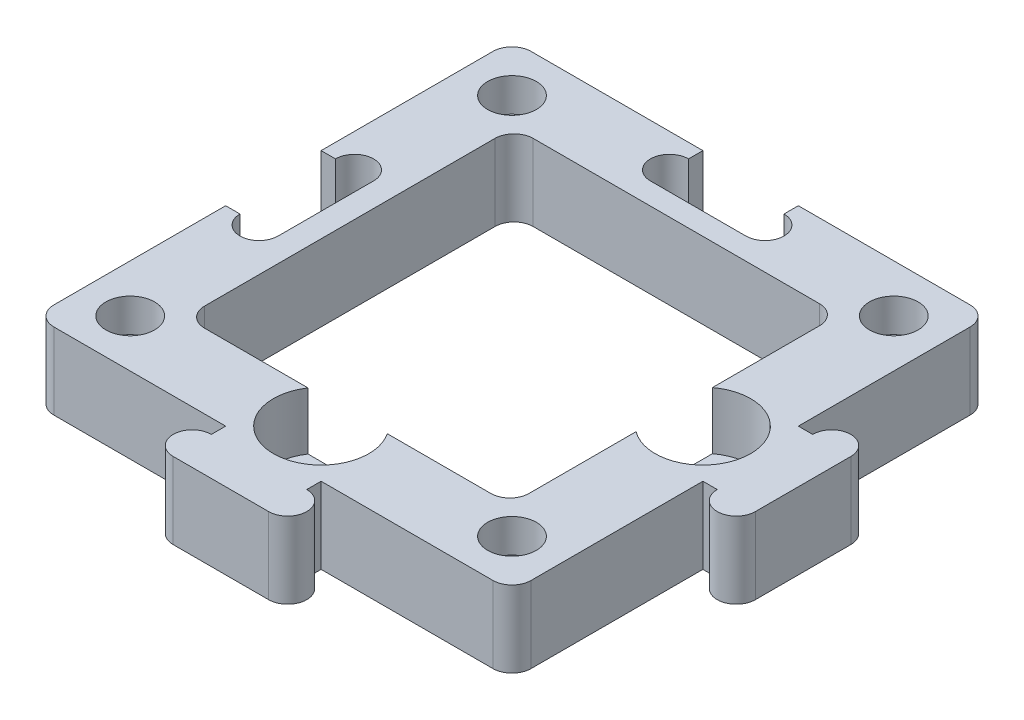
ISO-10303-21;
HEADER;
FILE_DESCRIPTION(('STEP AP214'),'2;1');
FILE_NAME('part.step','',(''),(''),'','','');
FILE_SCHEMA(('AUTOMOTIVE_DESIGN { 1 0 10303 214 1 1 1 1 }'));
ENDSEC;
DATA;
#1=APPLICATION_CONTEXT('core data for automotive mechanical design processes');
#2=APPLICATION_PROTOCOL_DEFINITION('international standard','automotive_design',2000,#1);
#3=PRODUCT_CONTEXT('',#1,'mechanical');
#4=PRODUCT('Part','Part','',(#3));
#5=PRODUCT_RELATED_PRODUCT_CATEGORY('part','',(#4));
#6=PRODUCT_DEFINITION_FORMATION('','',#4);
#7=PRODUCT_DEFINITION_CONTEXT('part definition',#1,'design');
#8=PRODUCT_DEFINITION('design','',#6,#7);
#9=PRODUCT_DEFINITION_SHAPE('','',#8);
#10=(LENGTH_UNIT() NAMED_UNIT(*) SI_UNIT(.MILLI.,.METRE.));
#11=(NAMED_UNIT(*) PLANE_ANGLE_UNIT() SI_UNIT($,.RADIAN.));
#12=(NAMED_UNIT(*) SI_UNIT($,.STERADIAN.) SOLID_ANGLE_UNIT());
#13=UNCERTAINTY_MEASURE_WITH_UNIT(LENGTH_MEASURE(1.E-05),#10,'distance_accuracy_value','');
#14=(GEOMETRIC_REPRESENTATION_CONTEXT(3) GLOBAL_UNCERTAINTY_ASSIGNED_CONTEXT((#13)) GLOBAL_UNIT_ASSIGNED_CONTEXT((#10,
#11,#12)) REPRESENTATION_CONTEXT('',''));
#15=CARTESIAN_POINT('',(0.,0.,0.));
#16=DIRECTION('',(0.,0.,1.));
#17=DIRECTION('',(1.,0.,0.));
#18=AXIS2_PLACEMENT_3D('',#15,#16,#17);
#19=CARTESIAN_POINT('',(-20.,8.,20.));
#20=DIRECTION('',(0.,-1.,0.));
#21=DIRECTION('',(0.,0.,-1.));
#22=AXIS2_PLACEMENT_3D('',#19,#20,#21);
#23=CYLINDRICAL_SURFACE('',#22,2.55);
#24=CARTESIAN_POINT('',(-20.,8.,20.));
#25=DIRECTION('',(0.,1.,0.));
#26=DIRECTION('',(0.,0.,1.));
#27=AXIS2_PLACEMENT_3D('',#24,#25,#26);
#28=CIRCLE('',#27,2.55);
#29=CARTESIAN_POINT('',(-20.,8.,22.55));
#30=VERTEX_POINT('',#29);
#31=EDGE_CURVE('E657',#30,#30,#28,.T.);
#32=ORIENTED_EDGE('',*,*,#31,.T.);
#33=EDGE_LOOP('',(#32));
#34=FACE_BOUND('',#33,.T.);
#35=CARTESIAN_POINT('',(-20.,4.5,20.));
#36=DIRECTION('',(0.,-1.,0.));
#37=DIRECTION('',(0.,0.,-1.));
#38=AXIS2_PLACEMENT_3D('',#35,#36,#37);
#39=CIRCLE('',#38,2.55);
#40=CARTESIAN_POINT('',(-20.,4.5,17.45));
#41=VERTEX_POINT('',#40);
#42=EDGE_CURVE('E55',#41,#41,#39,.T.);
#43=ORIENTED_EDGE('',*,*,#42,.T.);
#44=EDGE_LOOP('',(#43));
#45=FACE_BOUND('',#44,.T.);
#46=ADVANCED_FACE('F51',(#34,#45),#23,.F.);
#47=CARTESIAN_POINT('',(-19.9999999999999,8.,-20.0000000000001));
#48=DIRECTION('',(0.,-1.,0.));
#49=DIRECTION('',(0.,0.,-1.));
#50=AXIS2_PLACEMENT_3D('',#47,#48,#49);
#51=CYLINDRICAL_SURFACE('',#50,2.55);
#52=CARTESIAN_POINT('',(-19.9999999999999,8.,-20.0000000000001));
#53=DIRECTION('',(0.,1.,0.));
#54=DIRECTION('',(0.,0.,1.));
#55=AXIS2_PLACEMENT_3D('',#52,#53,#54);
#56=CIRCLE('',#55,2.55);
#57=CARTESIAN_POINT('',(-19.9999999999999,8.,-17.4500000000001));
#58=VERTEX_POINT('',#57);
#59=EDGE_CURVE('E654',#58,#58,#56,.T.);
#60=ORIENTED_EDGE('',*,*,#59,.T.);
#61=EDGE_LOOP('',(#60));
#62=FACE_BOUND('',#61,.T.);
#63=CARTESIAN_POINT('',(-19.9999999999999,4.5,-20.0000000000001));
#64=DIRECTION('',(0.,-1.,0.));
#65=DIRECTION('',(0.,0.,-1.));
#66=AXIS2_PLACEMENT_3D('',#63,#64,#65);
#67=CIRCLE('',#66,2.55);
#68=CARTESIAN_POINT('',(-19.9999999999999,4.5,-22.5500000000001));
#69=VERTEX_POINT('',#68);
#70=EDGE_CURVE('E387',#69,#69,#67,.T.);
#71=ORIENTED_EDGE('',*,*,#70,.T.);
#72=EDGE_LOOP('',(#71));
#73=FACE_BOUND('',#72,.T.);
#74=ADVANCED_FACE('F407',(#62,#73),#51,.F.);
#75=CARTESIAN_POINT('',(20.0000000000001,8.,-19.9999999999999));
#76=DIRECTION('',(0.,-1.,0.));
#77=DIRECTION('',(0.,0.,-1.));
#78=AXIS2_PLACEMENT_3D('',#75,#76,#77);
#79=CYLINDRICAL_SURFACE('',#78,2.55);
#80=CARTESIAN_POINT('',(20.0000000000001,8.,-19.9999999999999));
#81=DIRECTION('',(0.,1.,0.));
#82=DIRECTION('',(0.,0.,1.));
#83=AXIS2_PLACEMENT_3D('',#80,#81,#82);
#84=CIRCLE('',#83,2.55);
#85=CARTESIAN_POINT('',(20.0000000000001,8.,-17.4499999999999));
#86=VERTEX_POINT('',#85);
#87=EDGE_CURVE('E430',#86,#86,#84,.T.);
#88=ORIENTED_EDGE('',*,*,#87,.T.);
#89=EDGE_LOOP('',(#88));
#90=FACE_BOUND('',#89,.T.);
#91=CARTESIAN_POINT('',(20.0000000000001,4.5,-19.9999999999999));
#92=DIRECTION('',(0.,-1.,0.));
#93=DIRECTION('',(0.,0.,-1.));
#94=AXIS2_PLACEMENT_3D('',#91,#92,#93);
#95=CIRCLE('',#94,2.55);
#96=CARTESIAN_POINT('',(20.0000000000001,4.5,-22.5499999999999));
#97=VERTEX_POINT('',#96);
#98=EDGE_CURVE('E385',#97,#97,#95,.T.);
#99=ORIENTED_EDGE('',*,*,#98,.T.);
#100=EDGE_LOOP('',(#99));
#101=FACE_BOUND('',#100,.T.);
#102=ADVANCED_FACE('F414',(#90,#101),#79,.F.);
#103=CARTESIAN_POINT('',(19.9999999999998,8.,20.0000000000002));
#104=DIRECTION('',(0.,-1.,0.));
#105=DIRECTION('',(0.,0.,-1.));
#106=AXIS2_PLACEMENT_3D('',#103,#104,#105);
#107=CYLINDRICAL_SURFACE('',#106,2.55);
#108=CARTESIAN_POINT('',(19.9999999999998,8.,20.0000000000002));
#109=DIRECTION('',(0.,1.,0.));
#110=DIRECTION('',(0.,0.,1.));
#111=AXIS2_PLACEMENT_3D('',#108,#109,#110);
#112=CIRCLE('',#111,2.55);
#113=CARTESIAN_POINT('',(19.9999999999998,8.,22.5500000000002));
#114=VERTEX_POINT('',#113);
#115=EDGE_CURVE('E649',#114,#114,#112,.T.);
#116=ORIENTED_EDGE('',*,*,#115,.T.);
#117=EDGE_LOOP('',(#116));
#118=FACE_BOUND('',#117,.T.);
#119=CARTESIAN_POINT('',(19.9999999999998,4.5,20.0000000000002));
#120=DIRECTION('',(0.,-1.,0.));
#121=DIRECTION('',(0.,0.,-1.));
#122=AXIS2_PLACEMENT_3D('',#119,#120,#121);
#123=CIRCLE('',#122,2.55);
#124=CARTESIAN_POINT('',(19.9999999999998,4.5,17.4500000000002));
#125=VERTEX_POINT('',#124);
#126=EDGE_CURVE('E382',#125,#125,#123,.T.);
#127=ORIENTED_EDGE('',*,*,#126,.T.);
#128=EDGE_LOOP('',(#127));
#129=FACE_BOUND('',#128,.T.);
#130=ADVANCED_FACE('F53',(#118,#129),#107,.F.);
#131=CARTESIAN_POINT('',(20.,8.,0.));
#132=DIRECTION('',(0.,-1.,0.));
#133=DIRECTION('',(0.,0.,-1.));
#134=AXIS2_PLACEMENT_3D('',#131,#132,#133);
#135=CYLINDRICAL_SURFACE('',#134,3.25);
#136=DIRECTION('',(0.,-1.,0.));
#137=VECTOR('',#136,1.);
#138=CARTESIAN_POINT('',(17.,8.,1.24999999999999));
#139=LINE('',#138,#137);
#140=CARTESIAN_POINT('',(17.,2.,1.24999999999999));
#141=VERTEX_POINT('',#140);
#142=CARTESIAN_POINT('',(17.,0.,1.24999999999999));
#143=VERTEX_POINT('',#142);
#144=EDGE_CURVE('E883',#141,#143,#139,.T.);
#145=ORIENTED_EDGE('',*,*,#144,.F.);
#146=CARTESIAN_POINT('',(20.,2.,0.));
#147=DIRECTION('',(0.,1.,0.));
#148=DIRECTION('',(0.,0.,1.));
#149=AXIS2_PLACEMENT_3D('',#146,#147,#148);
#150=CIRCLE('',#149,3.25);
#151=CARTESIAN_POINT('',(17.,2.,-1.24999999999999));
#152=VERTEX_POINT('',#151);
#153=EDGE_CURVE('E640',#141,#152,#150,.T.);
#154=ORIENTED_EDGE('',*,*,#153,.T.);
#155=DIRECTION('',(0.,-1.,0.));
#156=VECTOR('',#155,1.);
#157=CARTESIAN_POINT('',(17.,8.,-1.24999999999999));
#158=LINE('',#157,#156);
#159=CARTESIAN_POINT('',(17.,0.,-1.24999999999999));
#160=VERTEX_POINT('',#159);
#161=EDGE_CURVE('E376',#152,#160,#158,.T.);
#162=ORIENTED_EDGE('',*,*,#161,.T.);
#163=CARTESIAN_POINT('',(20.,0.,0.));
#164=DIRECTION('',(0.,1.,0.));
#165=DIRECTION('',(0.,0.,1.));
#166=AXIS2_PLACEMENT_3D('',#163,#164,#165);
#167=CIRCLE('',#166,3.25);
#168=EDGE_CURVE('E648',#143,#160,#167,.T.);
#169=ORIENTED_EDGE('',*,*,#168,.F.);
#170=EDGE_LOOP('',(#145,#154,#162,#169));
#171=FACE_BOUND('',#170,.T.);
#172=ADVANCED_FACE('F419',(#171),#135,.F.);
#173=CARTESIAN_POINT('',(0.,8.,20.));
#174=DIRECTION('',(0.,-1.,0.));
#175=DIRECTION('',(0.,0.,-1.));
#176=AXIS2_PLACEMENT_3D('',#173,#174,#175);
#177=CYLINDRICAL_SURFACE('',#176,3.05);
#178=DIRECTION('',(0.,-1.,0.));
#179=VECTOR('',#178,1.);
#180=CARTESIAN_POINT('',(-1.25000000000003,8.,17.2179144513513));
#181=LINE('',#180,#179);
#182=CARTESIAN_POINT('',(-1.25000000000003,2.,17.2179144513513));
#183=VERTEX_POINT('',#182);
#184=CARTESIAN_POINT('',(-1.25000000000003,0.,17.2179144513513));
#185=VERTEX_POINT('',#184);
#186=EDGE_CURVE('E970',#183,#185,#181,.T.);
#187=ORIENTED_EDGE('',*,*,#186,.F.);
#188=CARTESIAN_POINT('',(0.,2.,20.));
#189=DIRECTION('',(0.,1.,0.));
#190=DIRECTION('',(0.,0.,1.));
#191=AXIS2_PLACEMENT_3D('',#188,#189,#190);
#192=CIRCLE('',#191,3.05);
#193=CARTESIAN_POINT('',(1.25000000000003,2.,17.2179144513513));
#194=VERTEX_POINT('',#193);
#195=EDGE_CURVE('E643',#183,#194,#192,.T.);
#196=ORIENTED_EDGE('',*,*,#195,.T.);
#197=DIRECTION('',(0.,-1.,0.));
#198=VECTOR('',#197,1.);
#199=CARTESIAN_POINT('',(1.25000000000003,8.,17.2179144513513));
#200=LINE('',#199,#198);
#201=CARTESIAN_POINT('',(1.25000000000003,0.,17.2179144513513));
#202=VERTEX_POINT('',#201);
#203=EDGE_CURVE('E972',#194,#202,#200,.T.);
#204=ORIENTED_EDGE('',*,*,#203,.T.);
#205=CARTESIAN_POINT('',(0.,0.,20.));
#206=DIRECTION('',(0.,1.,0.));
#207=DIRECTION('',(0.,0.,1.));
#208=AXIS2_PLACEMENT_3D('',#205,#206,#207);
#209=CIRCLE('',#208,3.05);
#210=EDGE_CURVE('E773',#185,#202,#209,.T.);
#211=ORIENTED_EDGE('',*,*,#210,.F.);
#212=EDGE_LOOP('',(#187,#196,#204,#211));
#213=FACE_BOUND('',#212,.T.);
#214=ADVANCED_FACE('F588',(#213),#177,.F.);
#215=CARTESIAN_POINT('',(0.,8.,-5.00000000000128));
#216=DIRECTION('',(0.,0.,-1.));
#217=DIRECTION('',(-1.,0.,0.));
#218=AXIS2_PLACEMENT_3D('',#215,#216,#217);
#219=PLANE('',#218);
#220=DIRECTION('',(1.,0.,0.));
#221=VECTOR('',#220,1.);
#222=CARTESIAN_POINT('',(0.,0.,-5.00000000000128));
#223=LINE('',#222,#221);
#224=CARTESIAN_POINT('',(-25.,0.,-5.00000000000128));
#225=VERTEX_POINT('',#224);
#226=CARTESIAN_POINT('',(-23.5,0.,-5.00000000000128));
#227=VERTEX_POINT('',#226);
#228=EDGE_CURVE('E797',#225,#227,#223,.T.);
#229=ORIENTED_EDGE('',*,*,#228,.T.);
#230=DIRECTION('',(0.,-1.,0.));
#231=VECTOR('',#230,1.);
#232=CARTESIAN_POINT('',(-23.5,8.,-5.00000000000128));
#233=LINE('',#232,#231);
#234=CARTESIAN_POINT('',(-23.5,8.,-5.00000000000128));
#235=VERTEX_POINT('',#234);
#236=EDGE_CURVE('E952',#235,#227,#233,.T.);
#237=ORIENTED_EDGE('',*,*,#236,.F.);
#238=DIRECTION('',(1.,0.,0.));
#239=VECTOR('',#238,1.);
#240=CARTESIAN_POINT('',(0.,8.,-5.00000000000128));
#241=LINE('',#240,#239);
#242=CARTESIAN_POINT('',(-25.,8.,-5.00000000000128));
#243=VERTEX_POINT('',#242);
#244=EDGE_CURVE('E684',#243,#235,#241,.T.);
#245=ORIENTED_EDGE('',*,*,#244,.F.);
#246=DIRECTION('',(0.,-1.,0.));
#247=VECTOR('',#246,1.);
#248=CARTESIAN_POINT('',(-25.,8.,-5.00000000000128));
#249=LINE('',#248,#247);
#250=EDGE_CURVE('E880',#243,#225,#249,.T.);
#251=ORIENTED_EDGE('',*,*,#250,.T.);
#252=EDGE_LOOP('',(#229,#237,#245,#251));
#253=FACE_BOUND('',#252,.T.);
#254=ADVANCED_FACE('F584',(#253),#219,.F.);
#255=CARTESIAN_POINT('',(-21.5,8.,-5.00000000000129));
#256=DIRECTION('',(0.,-1.,0.));
#257=DIRECTION('',(0.,0.,-1.));
#258=AXIS2_PLACEMENT_3D('',#255,#256,#257);
#259=CYLINDRICAL_SURFACE('',#258,2.);
#260=CARTESIAN_POINT('',(-21.5,0.,-5.00000000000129));
#261=DIRECTION('',(0.,1.,0.));
#262=DIRECTION('',(0.,0.,1.));
#263=AXIS2_PLACEMENT_3D('',#260,#261,#262);
#264=CIRCLE('',#263,2.);
#265=CARTESIAN_POINT('',(-19.5,0.,-5.00000000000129));
#266=VERTEX_POINT('',#265);
#267=EDGE_CURVE('E800',#227,#266,#264,.F.);
#268=ORIENTED_EDGE('',*,*,#267,.T.);
#269=DIRECTION('',(0.,-1.,0.));
#270=VECTOR('',#269,1.);
#271=CARTESIAN_POINT('',(-19.5,8.,-5.00000000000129));
#272=LINE('',#271,#270);
#273=CARTESIAN_POINT('',(-19.5,8.,-5.00000000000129));
#274=VERTEX_POINT('',#273);
#275=EDGE_CURVE('E950',#274,#266,#272,.T.);
#276=ORIENTED_EDGE('',*,*,#275,.F.);
#277=CARTESIAN_POINT('',(-21.5,8.,-5.00000000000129));
#278=DIRECTION('',(0.,1.,0.));
#279=DIRECTION('',(0.,0.,1.));
#280=AXIS2_PLACEMENT_3D('',#277,#278,#279);
#281=CIRCLE('',#280,2.);
#282=EDGE_CURVE('E687',#235,#274,#281,.F.);
#283=ORIENTED_EDGE('',*,*,#282,.F.);
#284=ORIENTED_EDGE('',*,*,#236,.T.);
#285=EDGE_LOOP('',(#268,#276,#283,#284));
#286=FACE_BOUND('',#285,.T.);
#287=ADVANCED_FACE('F580',(#286),#259,.F.);
#288=CARTESIAN_POINT('',(-19.5,8.,0.));
#289=DIRECTION('',(-1.,0.,0.));
#290=DIRECTION('',(0.,0.,1.));
#291=AXIS2_PLACEMENT_3D('',#288,#289,#290);
#292=PLANE('',#291);
#293=DIRECTION('',(0.,0.,-1.));
#294=VECTOR('',#293,1.);
#295=CARTESIAN_POINT('',(-19.5,0.,0.));
#296=LINE('',#295,#294);
#297=CARTESIAN_POINT('',(-19.5,0.,4.99999999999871));
#298=VERTEX_POINT('',#297);
#299=EDGE_CURVE('E803',#298,#266,#296,.T.);
#300=ORIENTED_EDGE('',*,*,#299,.F.);
#301=DIRECTION('',(0.,-1.,0.));
#302=VECTOR('',#301,1.);
#303=CARTESIAN_POINT('',(-19.5,8.,4.99999999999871));
#304=LINE('',#303,#302);
#305=CARTESIAN_POINT('',(-19.5,8.,4.99999999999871));
#306=VERTEX_POINT('',#305);
#307=EDGE_CURVE('E948',#306,#298,#304,.T.);
#308=ORIENTED_EDGE('',*,*,#307,.F.);
#309=DIRECTION('',(0.,0.,-1.));
#310=VECTOR('',#309,1.);
#311=CARTESIAN_POINT('',(-19.5,8.,0.));
#312=LINE('',#311,#310);
#313=EDGE_CURVE('E689',#306,#274,#312,.T.);
#314=ORIENTED_EDGE('',*,*,#313,.T.);
#315=ORIENTED_EDGE('',*,*,#275,.T.);
#316=EDGE_LOOP('',(#300,#308,#314,#315));
#317=FACE_BOUND('',#316,.T.);
#318=ADVANCED_FACE('F576',(#317),#292,.T.);
#319=CARTESIAN_POINT('',(-21.5,8.,4.99999999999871));
#320=DIRECTION('',(0.,-1.,0.));
#321=DIRECTION('',(0.,0.,-1.));
#322=AXIS2_PLACEMENT_3D('',#319,#320,#321);
#323=CYLINDRICAL_SURFACE('',#322,2.);
#324=CARTESIAN_POINT('',(-21.5,0.,4.99999999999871));
#325=DIRECTION('',(0.,1.,0.));
#326=DIRECTION('',(0.,0.,1.));
#327=AXIS2_PLACEMENT_3D('',#324,#325,#326);
#328=CIRCLE('',#327,2.);
#329=CARTESIAN_POINT('',(-23.5,0.,4.99999999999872));
#330=VERTEX_POINT('',#329);
#331=EDGE_CURVE('E806',#330,#298,#328,.T.);
#332=ORIENTED_EDGE('',*,*,#331,.F.);
#333=DIRECTION('',(0.,-1.,0.));
#334=VECTOR('',#333,1.);
#335=CARTESIAN_POINT('',(-23.5,8.,4.99999999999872));
#336=LINE('',#335,#334);
#337=CARTESIAN_POINT('',(-23.5,8.,4.99999999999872));
#338=VERTEX_POINT('',#337);
#339=EDGE_CURVE('E946',#338,#330,#336,.T.);
#340=ORIENTED_EDGE('',*,*,#339,.F.);
#341=CARTESIAN_POINT('',(-21.5,8.,4.99999999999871));
#342=DIRECTION('',(0.,1.,0.));
#343=DIRECTION('',(0.,0.,1.));
#344=AXIS2_PLACEMENT_3D('',#341,#342,#343);
#345=CIRCLE('',#344,2.);
#346=EDGE_CURVE('E692',#338,#306,#345,.T.);
#347=ORIENTED_EDGE('',*,*,#346,.T.);
#348=ORIENTED_EDGE('',*,*,#307,.T.);
#349=EDGE_LOOP('',(#332,#340,#347,#348));
#350=FACE_BOUND('',#349,.T.);
#351=ADVANCED_FACE('F572',(#350),#323,.F.);
#352=CARTESIAN_POINT('',(0.,8.,4.99999999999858));
#353=DIRECTION('',(0.,0.,-1.));
#354=DIRECTION('',(-1.,0.,0.));
#355=AXIS2_PLACEMENT_3D('',#352,#353,#354);
#356=PLANE('',#355);
#357=DIRECTION('',(1.,0.,0.));
#358=VECTOR('',#357,1.);
#359=CARTESIAN_POINT('',(0.,0.,4.99999999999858));
#360=LINE('',#359,#358);
#361=CARTESIAN_POINT('',(-25.,0.,4.99999999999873));
#362=VERTEX_POINT('',#361);
#363=EDGE_CURVE('E809',#362,#330,#360,.T.);
#364=ORIENTED_EDGE('',*,*,#363,.F.);
#365=DIRECTION('',(0.,-1.,0.));
#366=VECTOR('',#365,1.);
#367=CARTESIAN_POINT('',(-25.,8.,4.99999999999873));
#368=LINE('',#367,#366);
#369=CARTESIAN_POINT('',(-25.,8.,4.99999999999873));
#370=VERTEX_POINT('',#369);
#371=EDGE_CURVE('E944',#370,#362,#368,.T.);
#372=ORIENTED_EDGE('',*,*,#371,.F.);
#373=DIRECTION('',(1.,0.,0.));
#374=VECTOR('',#373,1.);
#375=CARTESIAN_POINT('',(0.,8.,4.99999999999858));
#376=LINE('',#375,#374);
#377=EDGE_CURVE('E695',#370,#338,#376,.T.);
#378=ORIENTED_EDGE('',*,*,#377,.T.);
#379=ORIENTED_EDGE('',*,*,#339,.T.);
#380=EDGE_LOOP('',(#364,#372,#378,#379));
#381=FACE_BOUND('',#380,.T.);
#382=ADVANCED_FACE('F568',(#381),#356,.T.);
#383=CARTESIAN_POINT('',(-25.,8.,0.));
#384=DIRECTION('',(-1.,0.,0.));
#385=DIRECTION('',(0.,0.,1.));
#386=AXIS2_PLACEMENT_3D('',#383,#384,#385);
#387=PLANE('',#386);
#388=DIRECTION('',(0.,0.,-1.));
#389=VECTOR('',#388,1.);
#390=CARTESIAN_POINT('',(-25.,0.,0.));
#391=LINE('',#390,#389);
#392=CARTESIAN_POINT('',(-25.,0.,23.));
#393=VERTEX_POINT('',#392);
#394=EDGE_CURVE('E812',#393,#362,#391,.T.);
#395=ORIENTED_EDGE('',*,*,#394,.F.);
#396=DIRECTION('',(0.,-1.,0.));
#397=VECTOR('',#396,1.);
#398=CARTESIAN_POINT('',(-25.,8.,23.));
#399=LINE('',#398,#397);
#400=CARTESIAN_POINT('',(-25.,8.,23.));
#401=VERTEX_POINT('',#400);
#402=EDGE_CURVE('E942',#401,#393,#399,.T.);
#403=ORIENTED_EDGE('',*,*,#402,.F.);
#404=DIRECTION('',(0.,0.,-1.));
#405=VECTOR('',#404,1.);
#406=CARTESIAN_POINT('',(-25.,8.,0.));
#407=LINE('',#406,#405);
#408=EDGE_CURVE('E698',#401,#370,#407,.T.);
#409=ORIENTED_EDGE('',*,*,#408,.T.);
#410=ORIENTED_EDGE('',*,*,#371,.T.);
#411=EDGE_LOOP('',(#395,#403,#409,#410));
#412=FACE_BOUND('',#411,.T.);
#413=ADVANCED_FACE('F564',(#412),#387,.T.);
#414=CARTESIAN_POINT('',(-23.,8.,23.));
#415=DIRECTION('',(0.,-1.,0.));
#416=DIRECTION('',(0.,0.,-1.));
#417=AXIS2_PLACEMENT_3D('',#414,#415,#416);
#418=CYLINDRICAL_SURFACE('',#417,2.);
#419=CARTESIAN_POINT('',(-23.,0.,23.));
#420=DIRECTION('',(0.,1.,0.));
#421=DIRECTION('',(0.,0.,1.));
#422=AXIS2_PLACEMENT_3D('',#419,#420,#421);
#423=CIRCLE('',#422,2.);
#424=CARTESIAN_POINT('',(-23.,0.,25.));
#425=VERTEX_POINT('',#424);
#426=EDGE_CURVE('E815',#425,#393,#423,.F.);
#427=ORIENTED_EDGE('',*,*,#426,.F.);
#428=DIRECTION('',(0.,-1.,0.));
#429=VECTOR('',#428,1.);
#430=CARTESIAN_POINT('',(-23.,8.,25.));
#431=LINE('',#430,#429);
#432=CARTESIAN_POINT('',(-23.,8.,25.));
#433=VERTEX_POINT('',#432);
#434=EDGE_CURVE('E940',#433,#425,#431,.T.);
#435=ORIENTED_EDGE('',*,*,#434,.F.);
#436=CARTESIAN_POINT('',(-23.,8.,23.));
#437=DIRECTION('',(0.,1.,0.));
#438=DIRECTION('',(0.,0.,1.));
#439=AXIS2_PLACEMENT_3D('',#436,#437,#438);
#440=CIRCLE('',#439,2.);
#441=EDGE_CURVE('E701',#433,#401,#440,.F.);
#442=ORIENTED_EDGE('',*,*,#441,.T.);
#443=ORIENTED_EDGE('',*,*,#402,.T.);
#444=EDGE_LOOP('',(#427,#435,#442,#443));
#445=FACE_BOUND('',#444,.T.);
#446=ADVANCED_FACE('F561',(#445),#418,.T.);
#447=CARTESIAN_POINT('',(0.,8.,25.));
#448=DIRECTION('',(0.,0.,1.));
#449=DIRECTION('',(1.,0.,0.));
#450=AXIS2_PLACEMENT_3D('',#447,#448,#449);
#451=PLANE('',#450);
#452=DIRECTION('',(-1.,0.,0.));
#453=VECTOR('',#452,1.);
#454=CARTESIAN_POINT('',(0.,0.,25.));
#455=LINE('',#454,#453);
#456=CARTESIAN_POINT('',(-4.99999999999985,0.,25.));
#457=VERTEX_POINT('',#456);
#458=EDGE_CURVE('E818',#457,#425,#455,.T.);
#459=ORIENTED_EDGE('',*,*,#458,.F.);
#460=DIRECTION('',(0.,-1.,0.));
#461=VECTOR('',#460,1.);
#462=CARTESIAN_POINT('',(-4.99999999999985,8.,25.));
#463=LINE('',#462,#461);
#464=CARTESIAN_POINT('',(-4.99999999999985,8.,25.));
#465=VERTEX_POINT('',#464);
#466=EDGE_CURVE('E938',#465,#457,#463,.T.);
#467=ORIENTED_EDGE('',*,*,#466,.F.);
#468=DIRECTION('',(-1.,0.,0.));
#469=VECTOR('',#468,1.);
#470=CARTESIAN_POINT('',(0.,8.,25.));
#471=LINE('',#470,#469);
#472=EDGE_CURVE('E704',#465,#433,#471,.T.);
#473=ORIENTED_EDGE('',*,*,#472,.T.);
#474=ORIENTED_EDGE('',*,*,#434,.T.);
#475=EDGE_LOOP('',(#459,#467,#473,#474));
#476=FACE_BOUND('',#475,.T.);
#477=ADVANCED_FACE('F541',(#476),#451,.T.);
#478=CARTESIAN_POINT('',(-4.99999999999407,8.,-1.12178784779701E-12));
#479=DIRECTION('',(1.,0.,2.24357569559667E-13));
#480=DIRECTION('',(2.24357569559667E-13,0.,-1.));
#481=AXIS2_PLACEMENT_3D('',#478,#479,#480);
#482=PLANE('',#481);
#483=DIRECTION('',(-2.24357569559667E-13,0.,1.));
#484=VECTOR('',#483,1.);
#485=CARTESIAN_POINT('',(-4.99999999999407,0.,-1.12178784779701E-12));
#486=LINE('',#485,#484);
#487=CARTESIAN_POINT('',(-5.00000000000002,0.,26.5));
#488=VERTEX_POINT('',#487);
#489=EDGE_CURVE('E821',#457,#488,#486,.T.);
#490=ORIENTED_EDGE('',*,*,#489,.T.);
#491=DIRECTION('',(0.,-1.,0.));
#492=VECTOR('',#491,1.);
#493=CARTESIAN_POINT('',(-5.00000000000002,8.,26.5));
#494=LINE('',#493,#492);
#495=CARTESIAN_POINT('',(-5.00000000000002,8.,26.5));
#496=VERTEX_POINT('',#495);
#497=EDGE_CURVE('E935',#496,#488,#494,.T.);
#498=ORIENTED_EDGE('',*,*,#497,.F.);
#499=DIRECTION('',(-2.24357569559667E-13,0.,1.));
#500=VECTOR('',#499,1.);
#501=CARTESIAN_POINT('',(-4.99999999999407,8.,-1.12178784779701E-12));
#502=LINE('',#501,#500);
#503=EDGE_CURVE('E707',#465,#496,#502,.T.);
#504=ORIENTED_EDGE('',*,*,#503,.F.);
#505=ORIENTED_EDGE('',*,*,#466,.T.);
#506=EDGE_LOOP('',(#490,#498,#504,#505));
#507=FACE_BOUND('',#506,.T.);
#508=ADVANCED_FACE('F556',(#507),#482,.F.);
#509=CARTESIAN_POINT('',(-5.00000000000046,8.,28.5));
#510=DIRECTION('',(0.,-1.,0.));
#511=DIRECTION('',(0.,0.,-1.));
#512=AXIS2_PLACEMENT_3D('',#509,#510,#511);
#513=CYLINDRICAL_SURFACE('',#512,2.);
#514=CARTESIAN_POINT('',(-5.00000000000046,0.,28.5));
#515=DIRECTION('',(0.,1.,0.));
#516=DIRECTION('',(0.,0.,1.));
#517=AXIS2_PLACEMENT_3D('',#514,#515,#516);
#518=CIRCLE('',#517,2.);
#519=CARTESIAN_POINT('',(-5.0000000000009,0.,30.5));
#520=VERTEX_POINT('',#519);
#521=EDGE_CURVE('E824',#488,#520,#518,.T.);
#522=ORIENTED_EDGE('',*,*,#521,.T.);
#523=DIRECTION('',(0.,-1.,0.));
#524=VECTOR('',#523,1.);
#525=CARTESIAN_POINT('',(-5.0000000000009,8.,30.5));
#526=LINE('',#525,#524);
#527=CARTESIAN_POINT('',(-5.0000000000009,8.,30.5));
#528=VERTEX_POINT('',#527);
#529=EDGE_CURVE('E933',#528,#520,#526,.T.);
#530=ORIENTED_EDGE('',*,*,#529,.F.);
#531=CARTESIAN_POINT('',(-5.00000000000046,8.,28.5));
#532=DIRECTION('',(0.,1.,0.));
#533=DIRECTION('',(0.,0.,1.));
#534=AXIS2_PLACEMENT_3D('',#531,#532,#533);
#535=CIRCLE('',#534,2.);
#536=EDGE_CURVE('E710',#496,#528,#535,.T.);
#537=ORIENTED_EDGE('',*,*,#536,.F.);
#538=ORIENTED_EDGE('',*,*,#497,.T.);
#539=EDGE_LOOP('',(#522,#530,#537,#538));
#540=FACE_BOUND('',#539,.T.);
#541=ADVANCED_FACE('F552',(#540),#513,.T.);
#542=CARTESIAN_POINT('',(-6.73003319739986E-12,8.,30.5000000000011));
#543=DIRECTION('',(-2.2065682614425E-13,0.,1.));
#544=DIRECTION('',(1.,0.,2.2065682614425E-13));
#545=AXIS2_PLACEMENT_3D('',#542,#543,#544);
#546=PLANE('',#545);
#547=DIRECTION('',(-1.,0.,-2.2065682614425E-13));
#548=VECTOR('',#547,1.);
#549=CARTESIAN_POINT('',(-6.73003319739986E-12,0.,30.5000000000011));
#550=LINE('',#549,#548);
#551=CARTESIAN_POINT('',(4.9999999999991,0.,30.5000000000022));
#552=VERTEX_POINT('',#551);
#553=EDGE_CURVE('E827',#552,#520,#550,.T.);
#554=ORIENTED_EDGE('',*,*,#553,.F.);
#555=DIRECTION('',(0.,-1.,0.));
#556=VECTOR('',#555,1.);
#557=CARTESIAN_POINT('',(4.9999999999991,8.,30.5000000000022));
#558=LINE('',#557,#556);
#559=CARTESIAN_POINT('',(4.9999999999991,8.,30.5000000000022));
#560=VERTEX_POINT('',#559);
#561=EDGE_CURVE('E931',#560,#552,#558,.T.);
#562=ORIENTED_EDGE('',*,*,#561,.F.);
#563=DIRECTION('',(-1.,0.,-2.2065682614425E-13));
#564=VECTOR('',#563,1.);
#565=CARTESIAN_POINT('',(-6.73003319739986E-12,8.,30.5000000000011));
#566=LINE('',#565,#564);
#567=EDGE_CURVE('E712',#560,#528,#566,.T.);
#568=ORIENTED_EDGE('',*,*,#567,.T.);
#569=ORIENTED_EDGE('',*,*,#529,.T.);
#570=EDGE_LOOP('',(#554,#562,#568,#569));
#571=FACE_BOUND('',#570,.T.);
#572=ADVANCED_FACE('F548',(#571),#546,.T.);
#573=CARTESIAN_POINT('',(4.99999999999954,8.,28.5000000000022));
#574=DIRECTION('',(0.,-1.,0.));
#575=DIRECTION('',(0.,0.,-1.));
#576=AXIS2_PLACEMENT_3D('',#573,#574,#575);
#577=CYLINDRICAL_SURFACE('',#576,2.00000000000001);
#578=CARTESIAN_POINT('',(4.99999999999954,0.,28.5000000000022));
#579=DIRECTION('',(0.,1.,0.));
#580=DIRECTION('',(0.,0.,1.));
#581=AXIS2_PLACEMENT_3D('',#578,#579,#580);
#582=CIRCLE('',#581,2.00000000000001);
#583=CARTESIAN_POINT('',(5.,0.,26.5000000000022));
#584=VERTEX_POINT('',#583);
#585=EDGE_CURVE('E830',#584,#552,#582,.F.);
#586=ORIENTED_EDGE('',*,*,#585,.F.);
#587=DIRECTION('',(0.,-1.,0.));
#588=VECTOR('',#587,1.);
#589=CARTESIAN_POINT('',(5.,8.,26.5000000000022));
#590=LINE('',#589,#588);
#591=CARTESIAN_POINT('',(5.,8.,26.5000000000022));
#592=VERTEX_POINT('',#591);
#593=EDGE_CURVE('E929',#592,#584,#590,.T.);
#594=ORIENTED_EDGE('',*,*,#593,.F.);
#595=CARTESIAN_POINT('',(4.99999999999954,8.,28.5000000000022));
#596=DIRECTION('',(0.,1.,0.));
#597=DIRECTION('',(0.,0.,1.));
#598=AXIS2_PLACEMENT_3D('',#595,#596,#597);
#599=CIRCLE('',#598,2.00000000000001);
#600=EDGE_CURVE('E715',#592,#560,#599,.F.);
#601=ORIENTED_EDGE('',*,*,#600,.T.);
#602=ORIENTED_EDGE('',*,*,#561,.T.);
#603=EDGE_LOOP('',(#586,#594,#601,#602));
#604=FACE_BOUND('',#603,.T.);
#605=ADVANCED_FACE('F544',(#604),#577,.T.);
#606=CARTESIAN_POINT('',(5.,8.,0.));
#607=DIRECTION('',(-1.,0.,0.));
#608=DIRECTION('',(0.,0.,1.));
#609=AXIS2_PLACEMENT_3D('',#606,#607,#608);
#610=PLANE('',#609);
#611=DIRECTION('',(0.,0.,-1.));
#612=VECTOR('',#611,1.);
#613=CARTESIAN_POINT('',(5.,0.,0.));
#614=LINE('',#613,#612);
#615=CARTESIAN_POINT('',(5.,0.,25.));
#616=VERTEX_POINT('',#615);
#617=EDGE_CURVE('E833',#584,#616,#614,.T.);
#618=ORIENTED_EDGE('',*,*,#617,.T.);
#619=DIRECTION('',(0.,-1.,0.));
#620=VECTOR('',#619,1.);
#621=CARTESIAN_POINT('',(5.,8.,25.));
#622=LINE('',#621,#620);
#623=CARTESIAN_POINT('',(5.,8.,25.));
#624=VERTEX_POINT('',#623);
#625=EDGE_CURVE('E927',#624,#616,#622,.T.);
#626=ORIENTED_EDGE('',*,*,#625,.F.);
#627=DIRECTION('',(0.,0.,-1.));
#628=VECTOR('',#627,1.);
#629=CARTESIAN_POINT('',(5.,8.,0.));
#630=LINE('',#629,#628);
#631=EDGE_CURVE('E718',#592,#624,#630,.T.);
#632=ORIENTED_EDGE('',*,*,#631,.F.);
#633=ORIENTED_EDGE('',*,*,#593,.T.);
#634=EDGE_LOOP('',(#618,#626,#632,#633));
#635=FACE_BOUND('',#634,.T.);
#636=ADVANCED_FACE('F539',(#635),#610,.F.);
#637=CARTESIAN_POINT('',(23.,0.,25.));
#638=VERTEX_POINT('',#637);
#639=EDGE_CURVE('E822',#638,#616,#455,.T.);
#640=ORIENTED_EDGE('',*,*,#639,.F.);
#641=DIRECTION('',(0.,-1.,0.));
#642=VECTOR('',#641,1.);
#643=CARTESIAN_POINT('',(23.,8.,25.));
#644=LINE('',#643,#642);
#645=CARTESIAN_POINT('',(23.,8.,25.));
#646=VERTEX_POINT('',#645);
#647=EDGE_CURVE('E925',#646,#638,#644,.T.);
#648=ORIENTED_EDGE('',*,*,#647,.F.);
#649=EDGE_CURVE('E708',#646,#624,#471,.T.);
#650=ORIENTED_EDGE('',*,*,#649,.T.);
#651=ORIENTED_EDGE('',*,*,#625,.T.);
#652=EDGE_LOOP('',(#640,#648,#650,#651));
#653=FACE_BOUND('',#652,.T.);
#654=ADVANCED_FACE('F535',(#653),#451,.T.);
#655=CARTESIAN_POINT('',(23.,8.,23.));
#656=DIRECTION('',(0.,-1.,0.));
#657=DIRECTION('',(0.,0.,-1.));
#658=AXIS2_PLACEMENT_3D('',#655,#656,#657);
#659=CYLINDRICAL_SURFACE('',#658,2.);
#660=CARTESIAN_POINT('',(23.,0.,23.));
#661=DIRECTION('',(0.,1.,0.));
#662=DIRECTION('',(0.,0.,1.));
#663=AXIS2_PLACEMENT_3D('',#660,#661,#662);
#664=CIRCLE('',#663,2.);
#665=CARTESIAN_POINT('',(25.,0.,23.));
#666=VERTEX_POINT('',#665);
#667=EDGE_CURVE('E836',#638,#666,#664,.T.);
#668=ORIENTED_EDGE('',*,*,#667,.T.);
#669=DIRECTION('',(0.,-1.,0.));
#670=VECTOR('',#669,1.);
#671=CARTESIAN_POINT('',(25.,8.,23.));
#672=LINE('',#671,#670);
#673=CARTESIAN_POINT('',(25.,8.,23.));
#674=VERTEX_POINT('',#673);
#675=EDGE_CURVE('E922',#674,#666,#672,.T.);
#676=ORIENTED_EDGE('',*,*,#675,.F.);
#677=CARTESIAN_POINT('',(23.,8.,23.));
#678=DIRECTION('',(0.,1.,0.));
#679=DIRECTION('',(0.,0.,1.));
#680=AXIS2_PLACEMENT_3D('',#677,#678,#679);
#681=CIRCLE('',#680,2.);
#682=EDGE_CURVE('E720',#646,#674,#681,.T.);
#683=ORIENTED_EDGE('',*,*,#682,.F.);
#684=ORIENTED_EDGE('',*,*,#647,.T.);
#685=EDGE_LOOP('',(#668,#676,#683,#684));
#686=FACE_BOUND('',#685,.T.);
#687=ADVANCED_FACE('F532',(#686),#659,.T.);
#688=CARTESIAN_POINT('',(25.,8.,0.));
#689=DIRECTION('',(-1.,0.,0.));
#690=DIRECTION('',(0.,0.,1.));
#691=AXIS2_PLACEMENT_3D('',#688,#689,#690);
#692=PLANE('',#691);
#693=DIRECTION('',(0.,0.,-1.));
#694=VECTOR('',#693,1.);
#695=CARTESIAN_POINT('',(25.,0.,0.));
#696=LINE('',#695,#694);
#697=CARTESIAN_POINT('',(25.,0.,5.));
#698=VERTEX_POINT('',#697);
#699=EDGE_CURVE('E838',#666,#698,#696,.T.);
#700=ORIENTED_EDGE('',*,*,#699,.T.);
#701=DIRECTION('',(0.,-1.,0.));
#702=VECTOR('',#701,1.);
#703=CARTESIAN_POINT('',(25.,8.,5.));
#704=LINE('',#703,#702);
#705=CARTESIAN_POINT('',(25.,8.,5.));
#706=VERTEX_POINT('',#705);
#707=EDGE_CURVE('E919',#706,#698,#704,.T.);
#708=ORIENTED_EDGE('',*,*,#707,.F.);
#709=DIRECTION('',(0.,0.,-1.));
#710=VECTOR('',#709,1.);
#711=CARTESIAN_POINT('',(25.,8.,0.));
#712=LINE('',#711,#710);
#713=EDGE_CURVE('E722',#674,#706,#712,.T.);
#714=ORIENTED_EDGE('',*,*,#713,.F.);
#715=ORIENTED_EDGE('',*,*,#675,.T.);
#716=EDGE_LOOP('',(#700,#708,#714,#715));
#717=FACE_BOUND('',#716,.T.);
#718=ADVANCED_FACE('F512',(#717),#692,.F.);
#719=CARTESIAN_POINT('',(0.,8.,4.99999999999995));
#720=DIRECTION('',(0.,0.,-1.));
#721=DIRECTION('',(-1.,0.,0.));
#722=AXIS2_PLACEMENT_3D('',#719,#720,#721);
#723=PLANE('',#722);
#724=DIRECTION('',(1.,0.,0.));
#725=VECTOR('',#724,1.);
#726=CARTESIAN_POINT('',(0.,0.,4.99999999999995));
#727=LINE('',#726,#725);
#728=CARTESIAN_POINT('',(26.5,0.,5.));
#729=VERTEX_POINT('',#728);
#730=EDGE_CURVE('E840',#698,#729,#727,.T.);
#731=ORIENTED_EDGE('',*,*,#730,.T.);
#732=DIRECTION('',(0.,-1.,0.));
#733=VECTOR('',#732,1.);
#734=CARTESIAN_POINT('',(26.5,8.,5.));
#735=LINE('',#734,#733);
#736=CARTESIAN_POINT('',(26.5,8.,5.));
#737=VERTEX_POINT('',#736);
#738=EDGE_CURVE('E916',#737,#729,#735,.T.);
#739=ORIENTED_EDGE('',*,*,#738,.F.);
#740=DIRECTION('',(1.,0.,0.));
#741=VECTOR('',#740,1.);
#742=CARTESIAN_POINT('',(0.,8.,4.99999999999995));
#743=LINE('',#742,#741);
#744=EDGE_CURVE('E724',#706,#737,#743,.T.);
#745=ORIENTED_EDGE('',*,*,#744,.F.);
#746=ORIENTED_EDGE('',*,*,#707,.T.);
#747=EDGE_LOOP('',(#731,#739,#745,#746));
#748=FACE_BOUND('',#747,.T.);
#749=ADVANCED_FACE('F527',(#748),#723,.F.);
#750=CARTESIAN_POINT('',(28.5,8.,5.));
#751=DIRECTION('',(0.,-1.,0.));
#752=DIRECTION('',(0.,0.,-1.));
#753=AXIS2_PLACEMENT_3D('',#750,#751,#752);
#754=CYLINDRICAL_SURFACE('',#753,2.);
#755=CARTESIAN_POINT('',(28.5,0.,5.));
#756=DIRECTION('',(0.,1.,0.));
#757=DIRECTION('',(0.,0.,1.));
#758=AXIS2_PLACEMENT_3D('',#755,#756,#757);
#759=CIRCLE('',#758,2.);
#760=CARTESIAN_POINT('',(30.5,0.,5.));
#761=VERTEX_POINT('',#760);
#762=EDGE_CURVE('E843',#729,#761,#759,.T.);
#763=ORIENTED_EDGE('',*,*,#762,.T.);
#764=DIRECTION('',(0.,-1.,0.));
#765=VECTOR('',#764,1.);
#766=CARTESIAN_POINT('',(30.5,8.,5.));
#767=LINE('',#766,#765);
#768=CARTESIAN_POINT('',(30.5,8.,5.));
#769=VERTEX_POINT('',#768);
#770=EDGE_CURVE('E914',#769,#761,#767,.T.);
#771=ORIENTED_EDGE('',*,*,#770,.F.);
#772=CARTESIAN_POINT('',(28.5,8.,5.));
#773=DIRECTION('',(0.,1.,0.));
#774=DIRECTION('',(0.,0.,1.));
#775=AXIS2_PLACEMENT_3D('',#772,#773,#774);
#776=CIRCLE('',#775,2.);
#777=EDGE_CURVE('E727',#737,#769,#776,.T.);
#778=ORIENTED_EDGE('',*,*,#777,.F.);
#779=ORIENTED_EDGE('',*,*,#738,.T.);
#780=EDGE_LOOP('',(#763,#771,#778,#779));
#781=FACE_BOUND('',#780,.T.);
#782=ADVANCED_FACE('F523',(#781),#754,.T.);
#783=CARTESIAN_POINT('',(30.5,8.,0.));
#784=DIRECTION('',(1.,0.,0.));
#785=DIRECTION('',(0.,0.,-1.));
#786=AXIS2_PLACEMENT_3D('',#783,#784,#785);
#787=PLANE('',#786);
#788=DIRECTION('',(0.,0.,1.));
#789=VECTOR('',#788,1.);
#790=CARTESIAN_POINT('',(30.5,0.,0.));
#791=LINE('',#790,#789);
#792=CARTESIAN_POINT('',(30.5,0.,-5.));
#793=VERTEX_POINT('',#792);
#794=EDGE_CURVE('E846',#793,#761,#791,.T.);
#795=ORIENTED_EDGE('',*,*,#794,.F.);
#796=DIRECTION('',(0.,-1.,0.));
#797=VECTOR('',#796,1.);
#798=CARTESIAN_POINT('',(30.5,8.,-5.));
#799=LINE('',#798,#797);
#800=CARTESIAN_POINT('',(30.5,8.,-5.));
#801=VERTEX_POINT('',#800);
#802=EDGE_CURVE('E912',#801,#793,#799,.T.);
#803=ORIENTED_EDGE('',*,*,#802,.F.);
#804=DIRECTION('',(0.,0.,1.));
#805=VECTOR('',#804,1.);
#806=CARTESIAN_POINT('',(30.5,8.,0.));
#807=LINE('',#806,#805);
#808=EDGE_CURVE('E729',#801,#769,#807,.T.);
#809=ORIENTED_EDGE('',*,*,#808,.T.);
#810=ORIENTED_EDGE('',*,*,#770,.T.);
#811=EDGE_LOOP('',(#795,#803,#809,#810));
#812=FACE_BOUND('',#811,.T.);
#813=ADVANCED_FACE('F519',(#812),#787,.T.);
#814=CARTESIAN_POINT('',(28.5,8.,-5.));
#815=DIRECTION('',(0.,-1.,0.));
#816=DIRECTION('',(0.,0.,-1.));
#817=AXIS2_PLACEMENT_3D('',#814,#815,#816);
#818=CYLINDRICAL_SURFACE('',#817,2.);
#819=CARTESIAN_POINT('',(28.5,0.,-5.));
#820=DIRECTION('',(0.,1.,0.));
#821=DIRECTION('',(0.,0.,1.));
#822=AXIS2_PLACEMENT_3D('',#819,#820,#821);
#823=CIRCLE('',#822,2.);
#824=CARTESIAN_POINT('',(26.5,0.,-5.));
#825=VERTEX_POINT('',#824);
#826=EDGE_CURVE('E849',#825,#793,#823,.F.);
#827=ORIENTED_EDGE('',*,*,#826,.F.);
#828=DIRECTION('',(0.,-1.,0.));
#829=VECTOR('',#828,1.);
#830=CARTESIAN_POINT('',(26.5,8.,-5.));
#831=LINE('',#830,#829);
#832=CARTESIAN_POINT('',(26.5,8.,-5.));
#833=VERTEX_POINT('',#832);
#834=EDGE_CURVE('E910',#833,#825,#831,.T.);
#835=ORIENTED_EDGE('',*,*,#834,.F.);
#836=CARTESIAN_POINT('',(28.5,8.,-5.));
#837=DIRECTION('',(0.,1.,0.));
#838=DIRECTION('',(0.,0.,1.));
#839=AXIS2_PLACEMENT_3D('',#836,#837,#838);
#840=CIRCLE('',#839,2.);
#841=EDGE_CURVE('E732',#833,#801,#840,.F.);
#842=ORIENTED_EDGE('',*,*,#841,.T.);
#843=ORIENTED_EDGE('',*,*,#802,.T.);
#844=EDGE_LOOP('',(#827,#835,#842,#843));
#845=FACE_BOUND('',#844,.T.);
#846=ADVANCED_FACE('F515',(#845),#818,.T.);
#847=CARTESIAN_POINT('',(0.,8.,-4.99999999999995));
#848=DIRECTION('',(0.,0.,-1.));
#849=DIRECTION('',(-1.,0.,0.));
#850=AXIS2_PLACEMENT_3D('',#847,#848,#849);
#851=PLANE('',#850);
#852=DIRECTION('',(1.,0.,0.));
#853=VECTOR('',#852,1.);
#854=CARTESIAN_POINT('',(0.,0.,-4.99999999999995));
#855=LINE('',#854,#853);
#856=CARTESIAN_POINT('',(25.,0.,-5.));
#857=VERTEX_POINT('',#856);
#858=EDGE_CURVE('E852',#857,#825,#855,.T.);
#859=ORIENTED_EDGE('',*,*,#858,.F.);
#860=DIRECTION('',(0.,-1.,0.));
#861=VECTOR('',#860,1.);
#862=CARTESIAN_POINT('',(25.,8.,-5.));
#863=LINE('',#862,#861);
#864=CARTESIAN_POINT('',(25.,8.,-5.));
#865=VERTEX_POINT('',#864);
#866=EDGE_CURVE('E908',#865,#857,#863,.T.);
#867=ORIENTED_EDGE('',*,*,#866,.F.);
#868=DIRECTION('',(1.,0.,0.));
#869=VECTOR('',#868,1.);
#870=CARTESIAN_POINT('',(0.,8.,-4.99999999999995));
#871=LINE('',#870,#869);
#872=EDGE_CURVE('E735',#865,#833,#871,.T.);
#873=ORIENTED_EDGE('',*,*,#872,.T.);
#874=ORIENTED_EDGE('',*,*,#834,.T.);
#875=EDGE_LOOP('',(#859,#867,#873,#874));
#876=FACE_BOUND('',#875,.T.);
#877=ADVANCED_FACE('F510',(#876),#851,.T.);
#878=CARTESIAN_POINT('',(25.,0.,-23.));
#879=VERTEX_POINT('',#878);
#880=EDGE_CURVE('E841',#857,#879,#696,.T.);
#881=ORIENTED_EDGE('',*,*,#880,.T.);
#882=DIRECTION('',(0.,-1.,0.));
#883=VECTOR('',#882,1.);
#884=CARTESIAN_POINT('',(25.,8.,-23.));
#885=LINE('',#884,#883);
#886=CARTESIAN_POINT('',(25.,8.,-23.));
#887=VERTEX_POINT('',#886);
#888=EDGE_CURVE('E905',#887,#879,#885,.T.);
#889=ORIENTED_EDGE('',*,*,#888,.F.);
#890=EDGE_CURVE('E725',#865,#887,#712,.T.);
#891=ORIENTED_EDGE('',*,*,#890,.F.);
#892=ORIENTED_EDGE('',*,*,#866,.T.);
#893=EDGE_LOOP('',(#881,#889,#891,#892));
#894=FACE_BOUND('',#893,.T.);
#895=ADVANCED_FACE('F506',(#894),#692,.F.);
#896=CARTESIAN_POINT('',(23.,8.,-23.));
#897=DIRECTION('',(0.,-1.,0.));
#898=DIRECTION('',(0.,0.,-1.));
#899=AXIS2_PLACEMENT_3D('',#896,#897,#898);
#900=CYLINDRICAL_SURFACE('',#899,2.);
#901=CARTESIAN_POINT('',(23.,0.,-23.));
#902=DIRECTION('',(0.,1.,0.));
#903=DIRECTION('',(0.,0.,1.));
#904=AXIS2_PLACEMENT_3D('',#901,#902,#903);
#905=CIRCLE('',#904,2.);
#906=CARTESIAN_POINT('',(23.,0.,-25.));
#907=VERTEX_POINT('',#906);
#908=EDGE_CURVE('E855',#879,#907,#905,.T.);
#909=ORIENTED_EDGE('',*,*,#908,.T.);
#910=DIRECTION('',(0.,-1.,0.));
#911=VECTOR('',#910,1.);
#912=CARTESIAN_POINT('',(23.,8.,-25.));
#913=LINE('',#912,#911);
#914=CARTESIAN_POINT('',(23.,8.,-25.));
#915=VERTEX_POINT('',#914);
#916=EDGE_CURVE('E902',#915,#907,#913,.T.);
#917=ORIENTED_EDGE('',*,*,#916,.F.);
#918=CARTESIAN_POINT('',(23.,8.,-23.));
#919=DIRECTION('',(0.,1.,0.));
#920=DIRECTION('',(0.,0.,1.));
#921=AXIS2_PLACEMENT_3D('',#918,#919,#920);
#922=CIRCLE('',#921,2.);
#923=EDGE_CURVE('E738',#887,#915,#922,.T.);
#924=ORIENTED_EDGE('',*,*,#923,.F.);
#925=ORIENTED_EDGE('',*,*,#888,.T.);
#926=EDGE_LOOP('',(#909,#917,#924,#925));
#927=FACE_BOUND('',#926,.T.);
#928=ADVANCED_FACE('F502',(#927),#900,.T.);
#929=CARTESIAN_POINT('',(0.,8.,-25.));
#930=DIRECTION('',(0.,0.,1.));
#931=DIRECTION('',(1.,0.,0.));
#932=AXIS2_PLACEMENT_3D('',#929,#930,#931);
#933=PLANE('',#932);
#934=DIRECTION('',(-1.,0.,0.));
#935=VECTOR('',#934,1.);
#936=CARTESIAN_POINT('',(0.,0.,-25.));
#937=LINE('',#936,#935);
#938=CARTESIAN_POINT('',(5.,0.,-25.));
#939=VERTEX_POINT('',#938);
#940=EDGE_CURVE('E857',#907,#939,#937,.T.);
#941=ORIENTED_EDGE('',*,*,#940,.T.);
#942=DIRECTION('',(0.,-1.,0.));
#943=VECTOR('',#942,1.);
#944=CARTESIAN_POINT('',(5.,8.,-25.));
#945=LINE('',#944,#943);
#946=CARTESIAN_POINT('',(5.,8.,-25.));
#947=VERTEX_POINT('',#946);
#948=EDGE_CURVE('E899',#947,#939,#945,.T.);
#949=ORIENTED_EDGE('',*,*,#948,.F.);
#950=DIRECTION('',(-1.,0.,0.));
#951=VECTOR('',#950,1.);
#952=CARTESIAN_POINT('',(0.,8.,-25.));
#953=LINE('',#952,#951);
#954=EDGE_CURVE('E740',#915,#947,#953,.T.);
#955=ORIENTED_EDGE('',*,*,#954,.F.);
#956=ORIENTED_EDGE('',*,*,#916,.T.);
#957=EDGE_LOOP('',(#941,#949,#955,#956));
#958=FACE_BOUND('',#957,.T.);
#959=ADVANCED_FACE('F498',(#958),#933,.F.);
#960=CARTESIAN_POINT('',(5.,8.,0.));
#961=DIRECTION('',(1.,0.,0.));
#962=DIRECTION('',(0.,0.,-1.));
#963=AXIS2_PLACEMENT_3D('',#960,#961,#962);
#964=PLANE('',#963);
#965=DIRECTION('',(0.,0.,1.));
#966=VECTOR('',#965,1.);
#967=CARTESIAN_POINT('',(5.,0.,0.));
#968=LINE('',#967,#966);
#969=CARTESIAN_POINT('',(5.,0.,-23.5));
#970=VERTEX_POINT('',#969);
#971=EDGE_CURVE('E859',#939,#970,#968,.T.);
#972=ORIENTED_EDGE('',*,*,#971,.T.);
#973=DIRECTION('',(0.,-1.,0.));
#974=VECTOR('',#973,1.);
#975=CARTESIAN_POINT('',(5.,8.,-23.5));
#976=LINE('',#975,#974);
#977=CARTESIAN_POINT('',(5.,8.,-23.5));
#978=VERTEX_POINT('',#977);
#979=EDGE_CURVE('E896',#978,#970,#976,.T.);
#980=ORIENTED_EDGE('',*,*,#979,.F.);
#981=DIRECTION('',(0.,0.,1.));
#982=VECTOR('',#981,1.);
#983=CARTESIAN_POINT('',(5.,8.,0.));
#984=LINE('',#983,#982);
#985=EDGE_CURVE('E742',#947,#978,#984,.T.);
#986=ORIENTED_EDGE('',*,*,#985,.F.);
#987=ORIENTED_EDGE('',*,*,#948,.T.);
#988=EDGE_LOOP('',(#972,#980,#986,#987));
#989=FACE_BOUND('',#988,.T.);
#990=ADVANCED_FACE('F494',(#989),#964,.F.);
#991=CARTESIAN_POINT('',(5.,8.,-21.5));
#992=DIRECTION('',(0.,-1.,0.));
#993=DIRECTION('',(0.,0.,-1.));
#994=AXIS2_PLACEMENT_3D('',#991,#992,#993);
#995=CYLINDRICAL_SURFACE('',#994,2.);
#996=CARTESIAN_POINT('',(5.,0.,-21.5));
#997=DIRECTION('',(0.,1.,0.));
#998=DIRECTION('',(0.,0.,1.));
#999=AXIS2_PLACEMENT_3D('',#996,#997,#998);
#1000=CIRCLE('',#999,2.);
#1001=CARTESIAN_POINT('',(5.,0.,-19.5));
#1002=VERTEX_POINT('',#1001);
#1003=EDGE_CURVE('E861',#970,#1002,#1000,.F.);
#1004=ORIENTED_EDGE('',*,*,#1003,.T.);
#1005=DIRECTION('',(0.,-1.,0.));
#1006=VECTOR('',#1005,1.);
#1007=CARTESIAN_POINT('',(5.,8.,-19.5));
#1008=LINE('',#1007,#1006);
#1009=CARTESIAN_POINT('',(5.,8.,-19.5));
#1010=VERTEX_POINT('',#1009);
#1011=EDGE_CURVE('E894',#1010,#1002,#1008,.T.);
#1012=ORIENTED_EDGE('',*,*,#1011,.F.);
#1013=CARTESIAN_POINT('',(5.,8.,-21.5));
#1014=DIRECTION('',(0.,1.,0.));
#1015=DIRECTION('',(0.,0.,1.));
#1016=AXIS2_PLACEMENT_3D('',#1013,#1014,#1015);
#1017=CIRCLE('',#1016,2.);
#1018=EDGE_CURVE('E744',#978,#1010,#1017,.F.);
#1019=ORIENTED_EDGE('',*,*,#1018,.F.);
#1020=ORIENTED_EDGE('',*,*,#979,.T.);
#1021=EDGE_LOOP('',(#1004,#1012,#1019,#1020));
#1022=FACE_BOUND('',#1021,.T.);
#1023=ADVANCED_FACE('F490',(#1022),#995,.F.);
#1024=CARTESIAN_POINT('',(0.,8.,-19.5));
#1025=DIRECTION('',(0.,0.,-1.));
#1026=DIRECTION('',(-1.,0.,0.));
#1027=AXIS2_PLACEMENT_3D('',#1024,#1025,#1026);
#1028=PLANE('',#1027);
#1029=DIRECTION('',(1.,0.,0.));
#1030=VECTOR('',#1029,1.);
#1031=CARTESIAN_POINT('',(0.,0.,-19.5));
#1032=LINE('',#1031,#1030);
#1033=CARTESIAN_POINT('',(-5.,0.,-19.5));
#1034=VERTEX_POINT('',#1033);
#1035=EDGE_CURVE('E864',#1034,#1002,#1032,.T.);
#1036=ORIENTED_EDGE('',*,*,#1035,.F.);
#1037=DIRECTION('',(0.,-1.,0.));
#1038=VECTOR('',#1037,1.);
#1039=CARTESIAN_POINT('',(-5.,8.,-19.5));
#1040=LINE('',#1039,#1038);
#1041=CARTESIAN_POINT('',(-5.,8.,-19.5));
#1042=VERTEX_POINT('',#1041);
#1043=EDGE_CURVE('E892',#1042,#1034,#1040,.T.);
#1044=ORIENTED_EDGE('',*,*,#1043,.F.);
#1045=DIRECTION('',(1.,0.,0.));
#1046=VECTOR('',#1045,1.);
#1047=CARTESIAN_POINT('',(0.,8.,-19.5));
#1048=LINE('',#1047,#1046);
#1049=EDGE_CURVE('E746',#1042,#1010,#1048,.T.);
#1050=ORIENTED_EDGE('',*,*,#1049,.T.);
#1051=ORIENTED_EDGE('',*,*,#1011,.T.);
#1052=EDGE_LOOP('',(#1036,#1044,#1050,#1051));
#1053=FACE_BOUND('',#1052,.T.);
#1054=ADVANCED_FACE('F486',(#1053),#1028,.T.);
#1055=CARTESIAN_POINT('',(-5.,8.,-21.5));
#1056=DIRECTION('',(0.,-1.,0.));
#1057=DIRECTION('',(0.,0.,-1.));
#1058=AXIS2_PLACEMENT_3D('',#1055,#1056,#1057);
#1059=CYLINDRICAL_SURFACE('',#1058,2.);
#1060=CARTESIAN_POINT('',(-5.,0.,-21.5));
#1061=DIRECTION('',(0.,1.,0.));
#1062=DIRECTION('',(0.,0.,1.));
#1063=AXIS2_PLACEMENT_3D('',#1060,#1061,#1062);
#1064=CIRCLE('',#1063,2.);
#1065=CARTESIAN_POINT('',(-5.,0.,-23.5));
#1066=VERTEX_POINT('',#1065);
#1067=EDGE_CURVE('E867',#1066,#1034,#1064,.T.);
#1068=ORIENTED_EDGE('',*,*,#1067,.F.);
#1069=DIRECTION('',(0.,-1.,0.));
#1070=VECTOR('',#1069,1.);
#1071=CARTESIAN_POINT('',(-5.,8.,-23.5));
#1072=LINE('',#1071,#1070);
#1073=CARTESIAN_POINT('',(-5.,8.,-23.5));
#1074=VERTEX_POINT('',#1073);
#1075=EDGE_CURVE('E890',#1074,#1066,#1072,.T.);
#1076=ORIENTED_EDGE('',*,*,#1075,.F.);
#1077=CARTESIAN_POINT('',(-5.,8.,-21.5));
#1078=DIRECTION('',(0.,1.,0.));
#1079=DIRECTION('',(0.,0.,1.));
#1080=AXIS2_PLACEMENT_3D('',#1077,#1078,#1079);
#1081=CIRCLE('',#1080,2.);
#1082=EDGE_CURVE('E749',#1074,#1042,#1081,.T.);
#1083=ORIENTED_EDGE('',*,*,#1082,.T.);
#1084=ORIENTED_EDGE('',*,*,#1043,.T.);
#1085=EDGE_LOOP('',(#1068,#1076,#1083,#1084));
#1086=FACE_BOUND('',#1085,.T.);
#1087=ADVANCED_FACE('F482',(#1086),#1059,.F.);
#1088=CARTESIAN_POINT('',(-5.,8.,0.));
#1089=DIRECTION('',(1.,0.,0.));
#1090=DIRECTION('',(0.,0.,-1.));
#1091=AXIS2_PLACEMENT_3D('',#1088,#1089,#1090);
#1092=PLANE('',#1091);
#1093=DIRECTION('',(0.,0.,1.));
#1094=VECTOR('',#1093,1.);
#1095=CARTESIAN_POINT('',(-5.,0.,0.));
#1096=LINE('',#1095,#1094);
#1097=CARTESIAN_POINT('',(-5.,0.,-25.));
#1098=VERTEX_POINT('',#1097);
#1099=EDGE_CURVE('E870',#1098,#1066,#1096,.T.);
#1100=ORIENTED_EDGE('',*,*,#1099,.F.);
#1101=DIRECTION('',(0.,-1.,0.));
#1102=VECTOR('',#1101,1.);
#1103=CARTESIAN_POINT('',(-5.,8.,-25.));
#1104=LINE('',#1103,#1102);
#1105=CARTESIAN_POINT('',(-5.,8.,-25.));
#1106=VERTEX_POINT('',#1105);
#1107=EDGE_CURVE('E888',#1106,#1098,#1104,.T.);
#1108=ORIENTED_EDGE('',*,*,#1107,.F.);
#1109=DIRECTION('',(0.,0.,1.));
#1110=VECTOR('',#1109,1.);
#1111=CARTESIAN_POINT('',(-5.,8.,0.));
#1112=LINE('',#1111,#1110);
#1113=EDGE_CURVE('E752',#1106,#1074,#1112,.T.);
#1114=ORIENTED_EDGE('',*,*,#1113,.T.);
#1115=ORIENTED_EDGE('',*,*,#1075,.T.);
#1116=EDGE_LOOP('',(#1100,#1108,#1114,#1115));
#1117=FACE_BOUND('',#1116,.T.);
#1118=ADVANCED_FACE('F478',(#1117),#1092,.T.);
#1119=CARTESIAN_POINT('',(0.,8.,-25.));
#1120=DIRECTION('',(0.,0.,1.));
#1121=DIRECTION('',(1.,0.,0.));
#1122=AXIS2_PLACEMENT_3D('',#1119,#1120,#1121);
#1123=PLANE('',#1122);
#1124=DIRECTION('',(-1.,0.,0.));
#1125=VECTOR('',#1124,1.);
#1126=CARTESIAN_POINT('',(0.,0.,-25.));
#1127=LINE('',#1126,#1125);
#1128=CARTESIAN_POINT('',(-23.,0.,-25.));
#1129=VERTEX_POINT('',#1128);
#1130=EDGE_CURVE('E873',#1098,#1129,#1127,.T.);
#1131=ORIENTED_EDGE('',*,*,#1130,.T.);
#1132=DIRECTION('',(0.,-1.,0.));
#1133=VECTOR('',#1132,1.);
#1134=CARTESIAN_POINT('',(-23.,8.,-25.));
#1135=LINE('',#1134,#1133);
#1136=CARTESIAN_POINT('',(-23.,8.,-25.));
#1137=VERTEX_POINT('',#1136);
#1138=EDGE_CURVE('E885',#1137,#1129,#1135,.T.);
#1139=ORIENTED_EDGE('',*,*,#1138,.F.);
#1140=DIRECTION('',(-1.,0.,0.));
#1141=VECTOR('',#1140,1.);
#1142=CARTESIAN_POINT('',(0.,8.,-25.));
#1143=LINE('',#1142,#1141);
#1144=EDGE_CURVE('E755',#1106,#1137,#1143,.T.);
#1145=ORIENTED_EDGE('',*,*,#1144,.F.);
#1146=ORIENTED_EDGE('',*,*,#1107,.T.);
#1147=EDGE_LOOP('',(#1131,#1139,#1145,#1146));
#1148=FACE_BOUND('',#1147,.T.);
#1149=ADVANCED_FACE('F474',(#1148),#1123,.F.);
#1150=CARTESIAN_POINT('',(-23.,8.,-23.));
#1151=DIRECTION('',(0.,-1.,0.));
#1152=DIRECTION('',(0.,0.,-1.));
#1153=AXIS2_PLACEMENT_3D('',#1150,#1151,#1152);
#1154=CYLINDRICAL_SURFACE('',#1153,2.);
#1155=CARTESIAN_POINT('',(-23.,0.,-23.));
#1156=DIRECTION('',(0.,1.,0.));
#1157=DIRECTION('',(0.,0.,1.));
#1158=AXIS2_PLACEMENT_3D('',#1155,#1156,#1157);
#1159=CIRCLE('',#1158,2.);
#1160=CARTESIAN_POINT('',(-25.,0.,-23.));
#1161=VERTEX_POINT('',#1160);
#1162=EDGE_CURVE('E875',#1129,#1161,#1159,.T.);
#1163=ORIENTED_EDGE('',*,*,#1162,.T.);
#1164=DIRECTION('',(0.,-1.,0.));
#1165=VECTOR('',#1164,1.);
#1166=CARTESIAN_POINT('',(-25.,8.,-23.));
#1167=LINE('',#1166,#1165);
#1168=CARTESIAN_POINT('',(-25.,8.,-23.));
#1169=VERTEX_POINT('',#1168);
#1170=EDGE_CURVE('E882',#1169,#1161,#1167,.T.);
#1171=ORIENTED_EDGE('',*,*,#1170,.F.);
#1172=CARTESIAN_POINT('',(-23.,8.,-23.));
#1173=DIRECTION('',(0.,1.,0.));
#1174=DIRECTION('',(0.,0.,1.));
#1175=AXIS2_PLACEMENT_3D('',#1172,#1173,#1174);
#1176=CIRCLE('',#1175,2.);
#1177=EDGE_CURVE('E757',#1137,#1169,#1176,.T.);
#1178=ORIENTED_EDGE('',*,*,#1177,.F.);
#1179=ORIENTED_EDGE('',*,*,#1138,.T.);
#1180=EDGE_LOOP('',(#1163,#1171,#1178,#1179));
#1181=FACE_BOUND('',#1180,.T.);
#1182=ADVANCED_FACE('F470',(#1181),#1154,.T.);
#1183=CARTESIAN_POINT('',(17.,8.,0.));
#1184=DIRECTION('',(-1.,0.,0.));
#1185=DIRECTION('',(0.,0.,1.));
#1186=AXIS2_PLACEMENT_3D('',#1183,#1184,#1185);
#1187=PLANE('',#1186);
#1188=DIRECTION('',(0.,1.,0.));
#1189=VECTOR('',#1188,1.);
#1190=CARTESIAN_POINT('',(17.,2.,4.));
#1191=LINE('',#1190,#1189);
#1192=CARTESIAN_POINT('',(17.,2.,4.));
#1193=VERTEX_POINT('',#1192);
#1194=CARTESIAN_POINT('',(17.,8.,4.));
#1195=VERTEX_POINT('',#1194);
#1196=EDGE_CURVE('E76',#1193,#1195,#1191,.T.);
#1197=ORIENTED_EDGE('',*,*,#1196,.F.);
#1198=DIRECTION('',(0.,0.,-1.));
#1199=VECTOR('',#1198,1.);
#1200=CARTESIAN_POINT('',(17.,2.,0.));
#1201=LINE('',#1200,#1199);
#1202=EDGE_CURVE('E371',#1193,#141,#1201,.T.);
#1203=ORIENTED_EDGE('',*,*,#1202,.T.);
#1204=ORIENTED_EDGE('',*,*,#144,.T.);
#1205=DIRECTION('',(0.,0.,-1.));
#1206=VECTOR('',#1205,1.);
#1207=CARTESIAN_POINT('',(17.,0.,0.));
#1208=LINE('',#1207,#1206);
#1209=CARTESIAN_POINT('',(17.,0.,15.2179144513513));
#1210=VERTEX_POINT('',#1209);
#1211=EDGE_CURVE('E764',#1210,#143,#1208,.T.);
#1212=ORIENTED_EDGE('',*,*,#1211,.F.);
#1213=DIRECTION('',(0.,-1.,0.));
#1214=VECTOR('',#1213,1.);
#1215=CARTESIAN_POINT('',(17.,8.,15.2179144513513));
#1216=LINE('',#1215,#1214);
#1217=CARTESIAN_POINT('',(17.,8.,15.2179144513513));
#1218=VERTEX_POINT('',#1217);
#1219=EDGE_CURVE('E976',#1218,#1210,#1216,.T.);
#1220=ORIENTED_EDGE('',*,*,#1219,.F.);
#1221=DIRECTION('',(0.,0.,-1.));
#1222=VECTOR('',#1221,1.);
#1223=CARTESIAN_POINT('',(17.,8.,0.));
#1224=LINE('',#1223,#1222);
#1225=EDGE_CURVE('E633',#1218,#1195,#1224,.T.);
#1226=ORIENTED_EDGE('',*,*,#1225,.T.);
#1227=EDGE_LOOP('',(#1197,#1203,#1204,#1212,#1220,#1226));
#1228=FACE_BOUND('',#1227,.T.);
#1229=ADVANCED_FACE('F473',(#1228),#1187,.T.);
#1230=CARTESIAN_POINT('',(15.,8.,15.2179144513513));
#1231=DIRECTION('',(0.,-1.,0.));
#1232=DIRECTION('',(0.,0.,-1.));
#1233=AXIS2_PLACEMENT_3D('',#1230,#1231,#1232);
#1234=CYLINDRICAL_SURFACE('',#1233,2.);
#1235=CARTESIAN_POINT('',(15.,0.,15.2179144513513));
#1236=DIRECTION('',(0.,1.,0.));
#1237=DIRECTION('',(0.,0.,1.));
#1238=AXIS2_PLACEMENT_3D('',#1235,#1236,#1237);
#1239=CIRCLE('',#1238,2.);
#1240=CARTESIAN_POINT('',(15.,0.,17.2179144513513));
#1241=VERTEX_POINT('',#1240);
#1242=EDGE_CURVE('E767',#1241,#1210,#1239,.T.);
#1243=ORIENTED_EDGE('',*,*,#1242,.F.);
#1244=DIRECTION('',(0.,-1.,0.));
#1245=VECTOR('',#1244,1.);
#1246=CARTESIAN_POINT('',(15.,8.,17.2179144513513));
#1247=LINE('',#1246,#1245);
#1248=CARTESIAN_POINT('',(15.,8.,17.2179144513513));
#1249=VERTEX_POINT('',#1248);
#1250=EDGE_CURVE('E974',#1249,#1241,#1247,.T.);
#1251=ORIENTED_EDGE('',*,*,#1250,.F.);
#1252=CARTESIAN_POINT('',(15.,8.,15.2179144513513));
#1253=DIRECTION('',(0.,1.,0.));
#1254=DIRECTION('',(0.,0.,1.));
#1255=AXIS2_PLACEMENT_3D('',#1252,#1253,#1254);
#1256=CIRCLE('',#1255,2.);
#1257=EDGE_CURVE('E660',#1249,#1218,#1256,.T.);
#1258=ORIENTED_EDGE('',*,*,#1257,.T.);
#1259=ORIENTED_EDGE('',*,*,#1219,.T.);
#1260=EDGE_LOOP('',(#1243,#1251,#1258,#1259));
#1261=FACE_BOUND('',#1260,.T.);
#1262=ADVANCED_FACE('F622',(#1261),#1234,.F.);
#1263=CARTESIAN_POINT('',(0.,8.,17.2179144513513));
#1264=DIRECTION('',(0.,0.,1.));
#1265=DIRECTION('',(1.,0.,0.));
#1266=AXIS2_PLACEMENT_3D('',#1263,#1264,#1265);
#1267=PLANE('',#1266);
#1268=DIRECTION('',(-1.,0.,0.));
#1269=VECTOR('',#1268,1.);
#1270=CARTESIAN_POINT('',(0.,2.,17.2179144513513));
#1271=LINE('',#1270,#1269);
#1272=CARTESIAN_POINT('',(4.15451561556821,2.,17.2179144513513));
#1273=VERTEX_POINT('',#1272);
#1274=EDGE_CURVE('E646',#1273,#194,#1271,.T.);
#1275=ORIENTED_EDGE('',*,*,#1274,.F.);
#1276=DIRECTION('',(0.,1.,0.));
#1277=VECTOR('',#1276,1.);
#1278=CARTESIAN_POINT('',(4.15451561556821,2.,17.2179144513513));
#1279=LINE('',#1278,#1277);
#1280=CARTESIAN_POINT('',(4.15451561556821,8.,17.2179144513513));
#1281=VERTEX_POINT('',#1280);
#1282=EDGE_CURVE('E635',#1273,#1281,#1279,.T.);
#1283=ORIENTED_EDGE('',*,*,#1282,.T.);
#1284=DIRECTION('',(-1.,0.,0.));
#1285=VECTOR('',#1284,1.);
#1286=CARTESIAN_POINT('',(0.,8.,17.2179144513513));
#1287=LINE('',#1286,#1285);
#1288=EDGE_CURVE('E663',#1249,#1281,#1287,.T.);
#1289=ORIENTED_EDGE('',*,*,#1288,.F.);
#1290=ORIENTED_EDGE('',*,*,#1250,.T.);
#1291=DIRECTION('',(-1.,0.,0.));
#1292=VECTOR('',#1291,1.);
#1293=CARTESIAN_POINT('',(0.,0.,17.2179144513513));
#1294=LINE('',#1293,#1292);
#1295=EDGE_CURVE('E770',#1241,#202,#1294,.T.);
#1296=ORIENTED_EDGE('',*,*,#1295,.T.);
#1297=ORIENTED_EDGE('',*,*,#203,.F.);
#1298=EDGE_LOOP('',(#1275,#1283,#1289,#1290,#1296,#1297));
#1299=FACE_BOUND('',#1298,.T.);
#1300=ADVANCED_FACE('F615',(#1299),#1267,.F.);
#1301=CARTESIAN_POINT('',(0.,8.,17.2179144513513));
#1302=DIRECTION('',(0.,0.,1.));
#1303=DIRECTION('',(1.,0.,0.));
#1304=AXIS2_PLACEMENT_3D('',#1301,#1302,#1303);
#1305=PLANE('',#1304);
#1306=DIRECTION('',(-1.,0.,0.));
#1307=VECTOR('',#1306,1.);
#1308=CARTESIAN_POINT('',(0.,8.,17.2179144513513));
#1309=LINE('',#1308,#1307);
#1310=CARTESIAN_POINT('',(-4.15451561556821,8.,17.2179144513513));
#1311=VERTEX_POINT('',#1310);
#1312=CARTESIAN_POINT('',(-15.,8.,17.2179144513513));
#1313=VERTEX_POINT('',#1312);
#1314=EDGE_CURVE('E666',#1311,#1313,#1309,.T.);
#1315=ORIENTED_EDGE('',*,*,#1314,.F.);
#1316=DIRECTION('',(0.,1.,0.));
#1317=VECTOR('',#1316,1.);
#1318=CARTESIAN_POINT('',(-4.15451561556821,2.,17.2179144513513));
#1319=LINE('',#1318,#1317);
#1320=CARTESIAN_POINT('',(-4.15451561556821,2.,17.2179144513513));
#1321=VERTEX_POINT('',#1320);
#1322=EDGE_CURVE('E68',#1311,#1321,#1319,.F.);
#1323=ORIENTED_EDGE('',*,*,#1322,.T.);
#1324=DIRECTION('',(-1.,0.,0.));
#1325=VECTOR('',#1324,1.);
#1326=CARTESIAN_POINT('',(0.,2.,17.2179144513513));
#1327=LINE('',#1326,#1325);
#1328=EDGE_CURVE('E11',#183,#1321,#1327,.T.);
#1329=ORIENTED_EDGE('',*,*,#1328,.F.);
#1330=ORIENTED_EDGE('',*,*,#186,.T.);
#1331=DIRECTION('',(-1.,0.,0.));
#1332=VECTOR('',#1331,1.);
#1333=CARTESIAN_POINT('',(0.,0.,17.2179144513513));
#1334=LINE('',#1333,#1332);
#1335=CARTESIAN_POINT('',(-15.,0.,17.2179144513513));
#1336=VERTEX_POINT('',#1335);
#1337=EDGE_CURVE('E776',#185,#1336,#1334,.T.);
#1338=ORIENTED_EDGE('',*,*,#1337,.T.);
#1339=DIRECTION('',(0.,-1.,0.));
#1340=VECTOR('',#1339,1.);
#1341=CARTESIAN_POINT('',(-15.,8.,17.2179144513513));
#1342=LINE('',#1341,#1340);
#1343=EDGE_CURVE('E967',#1313,#1336,#1342,.T.);
#1344=ORIENTED_EDGE('',*,*,#1343,.F.);
#1345=EDGE_LOOP('',(#1315,#1323,#1329,#1330,#1338,#1344));
#1346=FACE_BOUND('',#1345,.T.);
#1347=ADVANCED_FACE('F611',(#1346),#1305,.F.);
#1348=CARTESIAN_POINT('',(-15.,8.,15.2179144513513));
#1349=DIRECTION('',(0.,-1.,0.));
#1350=DIRECTION('',(0.,0.,-1.));
#1351=AXIS2_PLACEMENT_3D('',#1348,#1349,#1350);
#1352=CYLINDRICAL_SURFACE('',#1351,2.);
#1353=CARTESIAN_POINT('',(-15.,0.,15.2179144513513));
#1354=DIRECTION('',(0.,1.,0.));
#1355=DIRECTION('',(0.,0.,1.));
#1356=AXIS2_PLACEMENT_3D('',#1353,#1354,#1355);
#1357=CIRCLE('',#1356,2.);
#1358=CARTESIAN_POINT('',(-17.,0.,15.2179144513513));
#1359=VERTEX_POINT('',#1358);
#1360=EDGE_CURVE('E779',#1336,#1359,#1357,.F.);
#1361=ORIENTED_EDGE('',*,*,#1360,.T.);
#1362=DIRECTION('',(0.,-1.,0.));
#1363=VECTOR('',#1362,1.);
#1364=CARTESIAN_POINT('',(-17.,8.,15.2179144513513));
#1365=LINE('',#1364,#1363);
#1366=CARTESIAN_POINT('',(-17.,8.,15.2179144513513));
#1367=VERTEX_POINT('',#1366);
#1368=EDGE_CURVE('E964',#1367,#1359,#1365,.T.);
#1369=ORIENTED_EDGE('',*,*,#1368,.F.);
#1370=CARTESIAN_POINT('',(-15.,8.,15.2179144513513));
#1371=DIRECTION('',(0.,1.,0.));
#1372=DIRECTION('',(0.,0.,1.));
#1373=AXIS2_PLACEMENT_3D('',#1370,#1371,#1372);
#1374=CIRCLE('',#1373,2.);
#1375=EDGE_CURVE('E668',#1313,#1367,#1374,.F.);
#1376=ORIENTED_EDGE('',*,*,#1375,.F.);
#1377=ORIENTED_EDGE('',*,*,#1343,.T.);
#1378=EDGE_LOOP('',(#1361,#1369,#1376,#1377));
#1379=FACE_BOUND('',#1378,.T.);
#1380=ADVANCED_FACE('F607',(#1379),#1352,.F.);
#1381=CARTESIAN_POINT('',(-17.,8.,0.));
#1382=DIRECTION('',(-1.,0.,0.));
#1383=DIRECTION('',(0.,0.,1.));
#1384=AXIS2_PLACEMENT_3D('',#1381,#1382,#1383);
#1385=PLANE('',#1384);
#1386=DIRECTION('',(0.,0.,-1.));
#1387=VECTOR('',#1386,1.);
#1388=CARTESIAN_POINT('',(-17.,0.,0.));
#1389=LINE('',#1388,#1387);
#1390=CARTESIAN_POINT('',(-17.,0.,-15.2179144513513));
#1391=VERTEX_POINT('',#1390);
#1392=EDGE_CURVE('E782',#1359,#1391,#1389,.T.);
#1393=ORIENTED_EDGE('',*,*,#1392,.T.);
#1394=DIRECTION('',(0.,-1.,0.));
#1395=VECTOR('',#1394,1.);
#1396=CARTESIAN_POINT('',(-17.,8.,-15.2179144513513));
#1397=LINE('',#1396,#1395);
#1398=CARTESIAN_POINT('',(-17.,8.,-15.2179144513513));
#1399=VERTEX_POINT('',#1398);
#1400=EDGE_CURVE('E962',#1399,#1391,#1397,.T.);
#1401=ORIENTED_EDGE('',*,*,#1400,.F.);
#1402=DIRECTION('',(0.,0.,-1.));
#1403=VECTOR('',#1402,1.);
#1404=CARTESIAN_POINT('',(-17.,8.,0.));
#1405=LINE('',#1404,#1403);
#1406=EDGE_CURVE('E671',#1367,#1399,#1405,.T.);
#1407=ORIENTED_EDGE('',*,*,#1406,.F.);
#1408=ORIENTED_EDGE('',*,*,#1368,.T.);
#1409=EDGE_LOOP('',(#1393,#1401,#1407,#1408));
#1410=FACE_BOUND('',#1409,.T.);
#1411=ADVANCED_FACE('F603',(#1410),#1385,.F.);
#1412=CARTESIAN_POINT('',(-15.,8.,-15.2179144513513));
#1413=DIRECTION('',(0.,-1.,0.));
#1414=DIRECTION('',(0.,0.,-1.));
#1415=AXIS2_PLACEMENT_3D('',#1412,#1413,#1414);
#1416=CYLINDRICAL_SURFACE('',#1415,2.);
#1417=CARTESIAN_POINT('',(-15.,0.,-15.2179144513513));
#1418=DIRECTION('',(0.,1.,0.));
#1419=DIRECTION('',(0.,0.,1.));
#1420=AXIS2_PLACEMENT_3D('',#1417,#1418,#1419);
#1421=CIRCLE('',#1420,2.);
#1422=CARTESIAN_POINT('',(-15.,0.,-17.2179144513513));
#1423=VERTEX_POINT('',#1422);
#1424=EDGE_CURVE('E785',#1423,#1391,#1421,.T.);
#1425=ORIENTED_EDGE('',*,*,#1424,.F.);
#1426=DIRECTION('',(0.,-1.,0.));
#1427=VECTOR('',#1426,1.);
#1428=CARTESIAN_POINT('',(-15.,8.,-17.2179144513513));
#1429=LINE('',#1428,#1427);
#1430=CARTESIAN_POINT('',(-15.,8.,-17.2179144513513));
#1431=VERTEX_POINT('',#1430);
#1432=EDGE_CURVE('E960',#1431,#1423,#1429,.T.);
#1433=ORIENTED_EDGE('',*,*,#1432,.F.);
#1434=CARTESIAN_POINT('',(-15.,8.,-15.2179144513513));
#1435=DIRECTION('',(0.,1.,0.));
#1436=DIRECTION('',(0.,0.,1.));
#1437=AXIS2_PLACEMENT_3D('',#1434,#1435,#1436);
#1438=CIRCLE('',#1437,2.);
#1439=EDGE_CURVE('E673',#1431,#1399,#1438,.T.);
#1440=ORIENTED_EDGE('',*,*,#1439,.T.);
#1441=ORIENTED_EDGE('',*,*,#1400,.T.);
#1442=EDGE_LOOP('',(#1425,#1433,#1440,#1441));
#1443=FACE_BOUND('',#1442,.T.);
#1444=ADVANCED_FACE('F599',(#1443),#1416,.F.);
#1445=CARTESIAN_POINT('',(0.,8.,-17.2179144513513));
#1446=DIRECTION('',(0.,0.,1.));
#1447=DIRECTION('',(1.,0.,0.));
#1448=AXIS2_PLACEMENT_3D('',#1445,#1446,#1447);
#1449=PLANE('',#1448);
#1450=DIRECTION('',(-1.,0.,0.));
#1451=VECTOR('',#1450,1.);
#1452=CARTESIAN_POINT('',(0.,0.,-17.2179144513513));
#1453=LINE('',#1452,#1451);
#1454=CARTESIAN_POINT('',(15.,0.,-17.2179144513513));
#1455=VERTEX_POINT('',#1454);
#1456=EDGE_CURVE('E788',#1455,#1423,#1453,.T.);
#1457=ORIENTED_EDGE('',*,*,#1456,.F.);
#1458=DIRECTION('',(0.,-1.,0.));
#1459=VECTOR('',#1458,1.);
#1460=CARTESIAN_POINT('',(15.,8.,-17.2179144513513));
#1461=LINE('',#1460,#1459);
#1462=CARTESIAN_POINT('',(15.,8.,-17.2179144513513));
#1463=VERTEX_POINT('',#1462);
#1464=EDGE_CURVE('E958',#1463,#1455,#1461,.T.);
#1465=ORIENTED_EDGE('',*,*,#1464,.F.);
#1466=DIRECTION('',(-1.,0.,0.));
#1467=VECTOR('',#1466,1.);
#1468=CARTESIAN_POINT('',(0.,8.,-17.2179144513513));
#1469=LINE('',#1468,#1467);
#1470=EDGE_CURVE('E676',#1463,#1431,#1469,.T.);
#1471=ORIENTED_EDGE('',*,*,#1470,.T.);
#1472=ORIENTED_EDGE('',*,*,#1432,.T.);
#1473=EDGE_LOOP('',(#1457,#1465,#1471,#1472));
#1474=FACE_BOUND('',#1473,.T.);
#1475=ADVANCED_FACE('F595',(#1474),#1449,.T.);
#1476=CARTESIAN_POINT('',(15.,8.,-15.2179144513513));
#1477=DIRECTION('',(0.,-1.,0.));
#1478=DIRECTION('',(0.,0.,-1.));
#1479=AXIS2_PLACEMENT_3D('',#1476,#1477,#1478);
#1480=CYLINDRICAL_SURFACE('',#1479,2.);
#1481=CARTESIAN_POINT('',(15.,0.,-15.2179144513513));
#1482=DIRECTION('',(0.,1.,0.));
#1483=DIRECTION('',(0.,0.,1.));
#1484=AXIS2_PLACEMENT_3D('',#1481,#1482,#1483);
#1485=CIRCLE('',#1484,2.);
#1486=CARTESIAN_POINT('',(17.,0.,-15.2179144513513));
#1487=VERTEX_POINT('',#1486);
#1488=EDGE_CURVE('E791',#1487,#1455,#1485,.T.);
#1489=ORIENTED_EDGE('',*,*,#1488,.F.);
#1490=DIRECTION('',(0.,-1.,0.));
#1491=VECTOR('',#1490,1.);
#1492=CARTESIAN_POINT('',(17.,8.,-15.2179144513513));
#1493=LINE('',#1492,#1491);
#1494=CARTESIAN_POINT('',(17.,8.,-15.2179144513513));
#1495=VERTEX_POINT('',#1494);
#1496=EDGE_CURVE('E956',#1495,#1487,#1493,.T.);
#1497=ORIENTED_EDGE('',*,*,#1496,.F.);
#1498=CARTESIAN_POINT('',(15.,8.,-15.2179144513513));
#1499=DIRECTION('',(0.,1.,0.));
#1500=DIRECTION('',(0.,0.,1.));
#1501=AXIS2_PLACEMENT_3D('',#1498,#1499,#1500);
#1502=CIRCLE('',#1501,2.);
#1503=EDGE_CURVE('E679',#1495,#1463,#1502,.T.);
#1504=ORIENTED_EDGE('',*,*,#1503,.T.);
#1505=ORIENTED_EDGE('',*,*,#1464,.T.);
#1506=EDGE_LOOP('',(#1489,#1497,#1504,#1505));
#1507=FACE_BOUND('',#1506,.T.);
#1508=ADVANCED_FACE('F592',(#1507),#1480,.F.);
#1509=CARTESIAN_POINT('',(17.,8.,0.));
#1510=DIRECTION('',(-1.,0.,0.));
#1511=DIRECTION('',(0.,0.,1.));
#1512=AXIS2_PLACEMENT_3D('',#1509,#1510,#1511);
#1513=PLANE('',#1512);
#1514=DIRECTION('',(0.,1.,0.));
#1515=VECTOR('',#1514,1.);
#1516=CARTESIAN_POINT('',(17.,2.,-3.99999999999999));
#1517=LINE('',#1516,#1515);
#1518=CARTESIAN_POINT('',(17.,8.,-3.99999999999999));
#1519=VERTEX_POINT('',#1518);
#1520=CARTESIAN_POINT('',(17.,2.,-3.99999999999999));
#1521=VERTEX_POINT('',#1520);
#1522=EDGE_CURVE('E357',#1519,#1521,#1517,.F.);
#1523=ORIENTED_EDGE('',*,*,#1522,.F.);
#1524=DIRECTION('',(0.,0.,-1.));
#1525=VECTOR('',#1524,1.);
#1526=CARTESIAN_POINT('',(17.,8.,0.));
#1527=LINE('',#1526,#1525);
#1528=EDGE_CURVE('E682',#1519,#1495,#1527,.T.);
#1529=ORIENTED_EDGE('',*,*,#1528,.T.);
#1530=ORIENTED_EDGE('',*,*,#1496,.T.);
#1531=DIRECTION('',(0.,0.,-1.));
#1532=VECTOR('',#1531,1.);
#1533=CARTESIAN_POINT('',(17.,0.,0.));
#1534=LINE('',#1533,#1532);
#1535=EDGE_CURVE('E794',#160,#1487,#1534,.T.);
#1536=ORIENTED_EDGE('',*,*,#1535,.F.);
#1537=ORIENTED_EDGE('',*,*,#161,.F.);
#1538=DIRECTION('',(0.,0.,-1.));
#1539=VECTOR('',#1538,1.);
#1540=CARTESIAN_POINT('',(17.,2.,0.));
#1541=LINE('',#1540,#1539);
#1542=EDGE_CURVE('E60',#152,#1521,#1541,.T.);
#1543=ORIENTED_EDGE('',*,*,#1542,.T.);
#1544=EDGE_LOOP('',(#1523,#1529,#1530,#1536,#1537,#1543));
#1545=FACE_BOUND('',#1544,.T.);
#1546=ADVANCED_FACE('F374',(#1545),#1513,.T.);
#1547=CARTESIAN_POINT('',(-25.,8.,0.));
#1548=DIRECTION('',(-1.,0.,0.));
#1549=DIRECTION('',(0.,0.,1.));
#1550=AXIS2_PLACEMENT_3D('',#1547,#1548,#1549);
#1551=PLANE('',#1550);
#1552=DIRECTION('',(0.,0.,-1.));
#1553=VECTOR('',#1552,1.);
#1554=CARTESIAN_POINT('',(-25.,0.,0.));
#1555=LINE('',#1554,#1553);
#1556=EDGE_CURVE('E652',#225,#1161,#1555,.T.);
#1557=ORIENTED_EDGE('',*,*,#1556,.F.);
#1558=ORIENTED_EDGE('',*,*,#250,.F.);
#1559=DIRECTION('',(0.,0.,-1.));
#1560=VECTOR('',#1559,1.);
#1561=CARTESIAN_POINT('',(-25.,8.,0.));
#1562=LINE('',#1561,#1560);
#1563=EDGE_CURVE('E759',#243,#1169,#1562,.T.);
#1564=ORIENTED_EDGE('',*,*,#1563,.T.);
#1565=ORIENTED_EDGE('',*,*,#1170,.T.);
#1566=EDGE_LOOP('',(#1557,#1558,#1564,#1565));
#1567=FACE_BOUND('',#1566,.T.);
#1568=ADVANCED_FACE('F462',(#1567),#1551,.T.);
#1569=CARTESIAN_POINT('',(0.,8.,0.));
#1570=DIRECTION('',(0.,1.,0.));
#1571=DIRECTION('',(0.,0.,1.));
#1572=AXIS2_PLACEMENT_3D('',#1569,#1570,#1571);
#1573=PLANE('',#1572);
#1574=CARTESIAN_POINT('',(0.,8.,20.));
#1575=DIRECTION('',(0.,1.,0.));
#1576=DIRECTION('',(0.,0.,1.));
#1577=AXIS2_PLACEMENT_3D('',#1574,#1575,#1576);
#1578=CIRCLE('',#1577,5.);
#1579=EDGE_CURVE('E377',#1311,#1281,#1578,.T.);
#1580=ORIENTED_EDGE('',*,*,#1579,.F.);
#1581=ORIENTED_EDGE('',*,*,#1314,.T.);
#1582=ORIENTED_EDGE('',*,*,#1375,.T.);
#1583=ORIENTED_EDGE('',*,*,#1406,.T.);
#1584=ORIENTED_EDGE('',*,*,#1439,.F.);
#1585=ORIENTED_EDGE('',*,*,#1470,.F.);
#1586=ORIENTED_EDGE('',*,*,#1503,.F.);
#1587=ORIENTED_EDGE('',*,*,#1528,.F.);
#1588=CARTESIAN_POINT('',(20.,8.,0.));
#1589=DIRECTION('',(0.,1.,0.));
#1590=DIRECTION('',(0.,0.,1.));
#1591=AXIS2_PLACEMENT_3D('',#1588,#1589,#1590);
#1592=CIRCLE('',#1591,5.);
#1593=EDGE_CURVE('E361',#1195,#1519,#1592,.T.);
#1594=ORIENTED_EDGE('',*,*,#1593,.F.);
#1595=ORIENTED_EDGE('',*,*,#1225,.F.);
#1596=ORIENTED_EDGE('',*,*,#1257,.F.);
#1597=ORIENTED_EDGE('',*,*,#1288,.T.);
#1598=EDGE_LOOP('',(#1580,#1581,#1582,#1583,#1584,#1585,#1586,#1587,#1594,#1595,#1596,#1597));
#1599=FACE_BOUND('',#1598,.T.);
#1600=ORIENTED_EDGE('',*,*,#115,.F.);
#1601=EDGE_LOOP('',(#1600));
#1602=FACE_BOUND('',#1601,.T.);
#1603=ORIENTED_EDGE('',*,*,#87,.F.);
#1604=EDGE_LOOP('',(#1603));
#1605=FACE_BOUND('',#1604,.T.);
#1606=ORIENTED_EDGE('',*,*,#59,.F.);
#1607=EDGE_LOOP('',(#1606));
#1608=FACE_BOUND('',#1607,.T.);
#1609=ORIENTED_EDGE('',*,*,#31,.F.);
#1610=EDGE_LOOP('',(#1609));
#1611=FACE_BOUND('',#1610,.T.);
#1612=ORIENTED_EDGE('',*,*,#244,.T.);
#1613=ORIENTED_EDGE('',*,*,#282,.T.);
#1614=ORIENTED_EDGE('',*,*,#313,.F.);
#1615=ORIENTED_EDGE('',*,*,#346,.F.);
#1616=ORIENTED_EDGE('',*,*,#377,.F.);
#1617=ORIENTED_EDGE('',*,*,#408,.F.);
#1618=ORIENTED_EDGE('',*,*,#441,.F.);
#1619=ORIENTED_EDGE('',*,*,#472,.F.);
#1620=ORIENTED_EDGE('',*,*,#503,.T.);
#1621=ORIENTED_EDGE('',*,*,#536,.T.);
#1622=ORIENTED_EDGE('',*,*,#567,.F.);
#1623=ORIENTED_EDGE('',*,*,#600,.F.);
#1624=ORIENTED_EDGE('',*,*,#631,.T.);
#1625=ORIENTED_EDGE('',*,*,#649,.F.);
#1626=ORIENTED_EDGE('',*,*,#682,.T.);
#1627=ORIENTED_EDGE('',*,*,#713,.T.);
#1628=ORIENTED_EDGE('',*,*,#744,.T.);
#1629=ORIENTED_EDGE('',*,*,#777,.T.);
#1630=ORIENTED_EDGE('',*,*,#808,.F.);
#1631=ORIENTED_EDGE('',*,*,#841,.F.);
#1632=ORIENTED_EDGE('',*,*,#872,.F.);
#1633=ORIENTED_EDGE('',*,*,#890,.T.);
#1634=ORIENTED_EDGE('',*,*,#923,.T.);
#1635=ORIENTED_EDGE('',*,*,#954,.T.);
#1636=ORIENTED_EDGE('',*,*,#985,.T.);
#1637=ORIENTED_EDGE('',*,*,#1018,.T.);
#1638=ORIENTED_EDGE('',*,*,#1049,.F.);
#1639=ORIENTED_EDGE('',*,*,#1082,.F.);
#1640=ORIENTED_EDGE('',*,*,#1113,.F.);
#1641=ORIENTED_EDGE('',*,*,#1144,.T.);
#1642=ORIENTED_EDGE('',*,*,#1177,.T.);
#1643=ORIENTED_EDGE('',*,*,#1563,.F.);
#1644=EDGE_LOOP('',(#1612,#1613,#1614,#1615,#1616,#1617,#1618,#1619,#1620,#1621,#1622,#1623,
#1624,#1625,#1626,#1627,#1628,#1629,#1630,#1631,#1632,#1633,#1634,#1635,#1636,#1637,#1638,#1639,
#1640,#1641,#1642,#1643));
#1645=FACE_BOUND('',#1644,.T.);
#1646=ADVANCED_FACE('F459',(#1599,#1602,#1605,#1608,#1611,#1645),#1573,.T.);
#1647=CARTESIAN_POINT('',(0.,0.,0.));
#1648=DIRECTION('',(0.,1.,0.));
#1649=DIRECTION('',(0.,0.,1.));
#1650=AXIS2_PLACEMENT_3D('',#1647,#1648,#1649);
#1651=PLANE('',#1650);
#1652=ORIENTED_EDGE('',*,*,#168,.T.);
#1653=ORIENTED_EDGE('',*,*,#1535,.T.);
#1654=ORIENTED_EDGE('',*,*,#1488,.T.);
#1655=ORIENTED_EDGE('',*,*,#1456,.T.);
#1656=ORIENTED_EDGE('',*,*,#1424,.T.);
#1657=ORIENTED_EDGE('',*,*,#1392,.F.);
#1658=ORIENTED_EDGE('',*,*,#1360,.F.);
#1659=ORIENTED_EDGE('',*,*,#1337,.F.);
#1660=ORIENTED_EDGE('',*,*,#210,.T.);
#1661=ORIENTED_EDGE('',*,*,#1295,.F.);
#1662=ORIENTED_EDGE('',*,*,#1242,.T.);
#1663=ORIENTED_EDGE('',*,*,#1211,.T.);
#1664=EDGE_LOOP('',(#1652,#1653,#1654,#1655,#1656,#1657,#1658,#1659,#1660,#1661,#1662,#1663));
#1665=FACE_BOUND('',#1664,.T.);
#1666=ORIENTED_EDGE('',*,*,#228,.F.);
#1667=ORIENTED_EDGE('',*,*,#1556,.T.);
#1668=ORIENTED_EDGE('',*,*,#1162,.F.);
#1669=ORIENTED_EDGE('',*,*,#1130,.F.);
#1670=ORIENTED_EDGE('',*,*,#1099,.T.);
#1671=ORIENTED_EDGE('',*,*,#1067,.T.);
#1672=ORIENTED_EDGE('',*,*,#1035,.T.);
#1673=ORIENTED_EDGE('',*,*,#1003,.F.);
#1674=ORIENTED_EDGE('',*,*,#971,.F.);
#1675=ORIENTED_EDGE('',*,*,#940,.F.);
#1676=ORIENTED_EDGE('',*,*,#908,.F.);
#1677=ORIENTED_EDGE('',*,*,#880,.F.);
#1678=ORIENTED_EDGE('',*,*,#858,.T.);
#1679=ORIENTED_EDGE('',*,*,#826,.T.);
#1680=ORIENTED_EDGE('',*,*,#794,.T.);
#1681=ORIENTED_EDGE('',*,*,#762,.F.);
#1682=ORIENTED_EDGE('',*,*,#730,.F.);
#1683=ORIENTED_EDGE('',*,*,#699,.F.);
#1684=ORIENTED_EDGE('',*,*,#667,.F.);
#1685=ORIENTED_EDGE('',*,*,#639,.T.);
#1686=ORIENTED_EDGE('',*,*,#617,.F.);
#1687=ORIENTED_EDGE('',*,*,#585,.T.);
#1688=ORIENTED_EDGE('',*,*,#553,.T.);
#1689=ORIENTED_EDGE('',*,*,#521,.F.);
#1690=ORIENTED_EDGE('',*,*,#489,.F.);
#1691=ORIENTED_EDGE('',*,*,#458,.T.);
#1692=ORIENTED_EDGE('',*,*,#426,.T.);
#1693=ORIENTED_EDGE('',*,*,#394,.T.);
#1694=ORIENTED_EDGE('',*,*,#363,.T.);
#1695=ORIENTED_EDGE('',*,*,#331,.T.);
#1696=ORIENTED_EDGE('',*,*,#299,.T.);
#1697=ORIENTED_EDGE('',*,*,#267,.F.);
#1698=EDGE_LOOP('',(#1666,#1667,#1668,#1669,#1670,#1671,#1672,#1673,#1674,#1675,#1676,#1677,
#1678,#1679,#1680,#1681,#1682,#1683,#1684,#1685,#1686,#1687,#1688,#1689,#1690,#1691,#1692,#1693,
#1694,#1695,#1696,#1697));
#1699=FACE_BOUND('',#1698,.T.);
#1700=ADVANCED_FACE('F456',(#1665,#1699),#1651,.F.);
#1701=CARTESIAN_POINT('',(20.,2.,0.));
#1702=DIRECTION('',(0.,1.,0.));
#1703=DIRECTION('',(0.,0.,1.));
#1704=AXIS2_PLACEMENT_3D('',#1701,#1702,#1703);
#1705=CYLINDRICAL_SURFACE('',#1704,5.);
#1706=ORIENTED_EDGE('',*,*,#1196,.T.);
#1707=ORIENTED_EDGE('',*,*,#1593,.T.);
#1708=ORIENTED_EDGE('',*,*,#1522,.T.);
#1709=CARTESIAN_POINT('',(20.,2.,0.));
#1710=DIRECTION('',(0.,1.,0.));
#1711=DIRECTION('',(0.,0.,1.));
#1712=AXIS2_PLACEMENT_3D('',#1709,#1710,#1711);
#1713=CIRCLE('',#1712,5.);
#1714=EDGE_CURVE('E360',#1193,#1521,#1713,.T.);
#1715=ORIENTED_EDGE('',*,*,#1714,.F.);
#1716=EDGE_LOOP('',(#1706,#1707,#1708,#1715));
#1717=FACE_BOUND('',#1716,.T.);
#1718=ADVANCED_FACE('F359',(#1717),#1705,.F.);
#1719=CARTESIAN_POINT('',(20.,2.,0.));
#1720=DIRECTION('',(0.,1.,0.));
#1721=DIRECTION('',(0.,0.,1.));
#1722=AXIS2_PLACEMENT_3D('',#1719,#1720,#1721);
#1723=PLANE('',#1722);
#1724=ORIENTED_EDGE('',*,*,#1714,.T.);
#1725=ORIENTED_EDGE('',*,*,#1542,.F.);
#1726=ORIENTED_EDGE('',*,*,#153,.F.);
#1727=ORIENTED_EDGE('',*,*,#1202,.F.);
#1728=EDGE_LOOP('',(#1724,#1725,#1726,#1727));
#1729=FACE_BOUND('',#1728,.T.);
#1730=ADVANCED_FACE('F368',(#1729),#1723,.T.);
#1731=CARTESIAN_POINT('',(0.,2.,20.));
#1732=DIRECTION('',(0.,1.,0.));
#1733=DIRECTION('',(0.,0.,1.));
#1734=AXIS2_PLACEMENT_3D('',#1731,#1732,#1733);
#1735=PLANE('',#1734);
#1736=ORIENTED_EDGE('',*,*,#1274,.T.);
#1737=ORIENTED_EDGE('',*,*,#195,.F.);
#1738=ORIENTED_EDGE('',*,*,#1328,.T.);
#1739=CARTESIAN_POINT('',(0.,2.,20.));
#1740=DIRECTION('',(0.,1.,0.));
#1741=DIRECTION('',(0.,0.,1.));
#1742=AXIS2_PLACEMENT_3D('',#1739,#1740,#1741);
#1743=CIRCLE('',#1742,5.);
#1744=EDGE_CURVE('E365',#1321,#1273,#1743,.T.);
#1745=ORIENTED_EDGE('',*,*,#1744,.T.);
#1746=EDGE_LOOP('',(#1736,#1737,#1738,#1745));
#1747=FACE_BOUND('',#1746,.T.);
#1748=ADVANCED_FACE('F445',(#1747),#1735,.T.);
#1749=CARTESIAN_POINT('',(0.,2.,20.));
#1750=DIRECTION('',(0.,1.,0.));
#1751=DIRECTION('',(0.,0.,1.));
#1752=AXIS2_PLACEMENT_3D('',#1749,#1750,#1751);
#1753=CYLINDRICAL_SURFACE('',#1752,5.);
#1754=ORIENTED_EDGE('',*,*,#1744,.F.);
#1755=ORIENTED_EDGE('',*,*,#1322,.F.);
#1756=ORIENTED_EDGE('',*,*,#1579,.T.);
#1757=ORIENTED_EDGE('',*,*,#1282,.F.);
#1758=EDGE_LOOP('',(#1754,#1755,#1756,#1757));
#1759=FACE_BOUND('',#1758,.T.);
#1760=ADVANCED_FACE('F439',(#1759),#1753,.F.);
#1761=CARTESIAN_POINT('',(19.9999999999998,4.5,20.0000000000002));
#1762=DIRECTION('',(0.,-1.,0.));
#1763=DIRECTION('',(0.,0.,-1.));
#1764=AXIS2_PLACEMENT_3D('',#1761,#1762,#1763);
#1765=PLANE('',#1764);
#1766=ORIENTED_EDGE('',*,*,#126,.F.);
#1767=EDGE_LOOP('',(#1766));
#1768=FACE_BOUND('',#1767,.T.);
#1769=ADVANCED_FACE('F434',(#1768),#1765,.F.);
#1770=CARTESIAN_POINT('',(20.0000000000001,4.5,-19.9999999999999));
#1771=DIRECTION('',(0.,-1.,0.));
#1772=DIRECTION('',(0.,0.,-1.));
#1773=AXIS2_PLACEMENT_3D('',#1770,#1771,#1772);
#1774=PLANE('',#1773);
#1775=ORIENTED_EDGE('',*,*,#98,.F.);
#1776=EDGE_LOOP('',(#1775));
#1777=FACE_BOUND('',#1776,.T.);
#1778=ADVANCED_FACE('F402',(#1777),#1774,.F.);
#1779=CARTESIAN_POINT('',(-19.9999999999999,4.5,-20.0000000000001));
#1780=DIRECTION('',(0.,-1.,0.));
#1781=DIRECTION('',(0.,0.,-1.));
#1782=AXIS2_PLACEMENT_3D('',#1779,#1780,#1781);
#1783=PLANE('',#1782);
#1784=ORIENTED_EDGE('',*,*,#70,.F.);
#1785=EDGE_LOOP('',(#1784));
#1786=FACE_BOUND('',#1785,.T.);
#1787=ADVANCED_FACE('F397',(#1786),#1783,.F.);
#1788=CARTESIAN_POINT('',(-20.,4.5,20.));
#1789=DIRECTION('',(0.,-1.,0.));
#1790=DIRECTION('',(0.,0.,-1.));
#1791=AXIS2_PLACEMENT_3D('',#1788,#1789,#1790);
#1792=PLANE('',#1791);
#1793=ORIENTED_EDGE('',*,*,#42,.F.);
#1794=EDGE_LOOP('',(#1793));
#1795=FACE_BOUND('',#1794,.T.);
#1796=ADVANCED_FACE('F395',(#1795),#1792,.F.);
#1797=CLOSED_SHELL('',(#46,#74,#102,#130,#172,#214,#254,#287,#318,#351,#382,#413,#446,#477,#508,
#541,#572,#605,#636,#654,#687,#718,#749,#782,#813,#846,#877,#895,#928,#959,#990,#1023,#1054,
#1087,#1118,#1149,#1182,#1229,#1262,#1300,#1347,#1380,#1411,#1444,#1475,#1508,#1546,#1568,#1646,
#1700,#1718,#1730,#1748,#1760,#1769,#1778,#1787,#1796));
#1798=MANIFOLD_SOLID_BREP('B2',#1797);
#1799=ADVANCED_BREP_SHAPE_REPRESENTATION('',(#18,#1798),#14);
#1800=SHAPE_DEFINITION_REPRESENTATION(#9,#1799);
ENDSEC;
END-ISO-10303-21;
